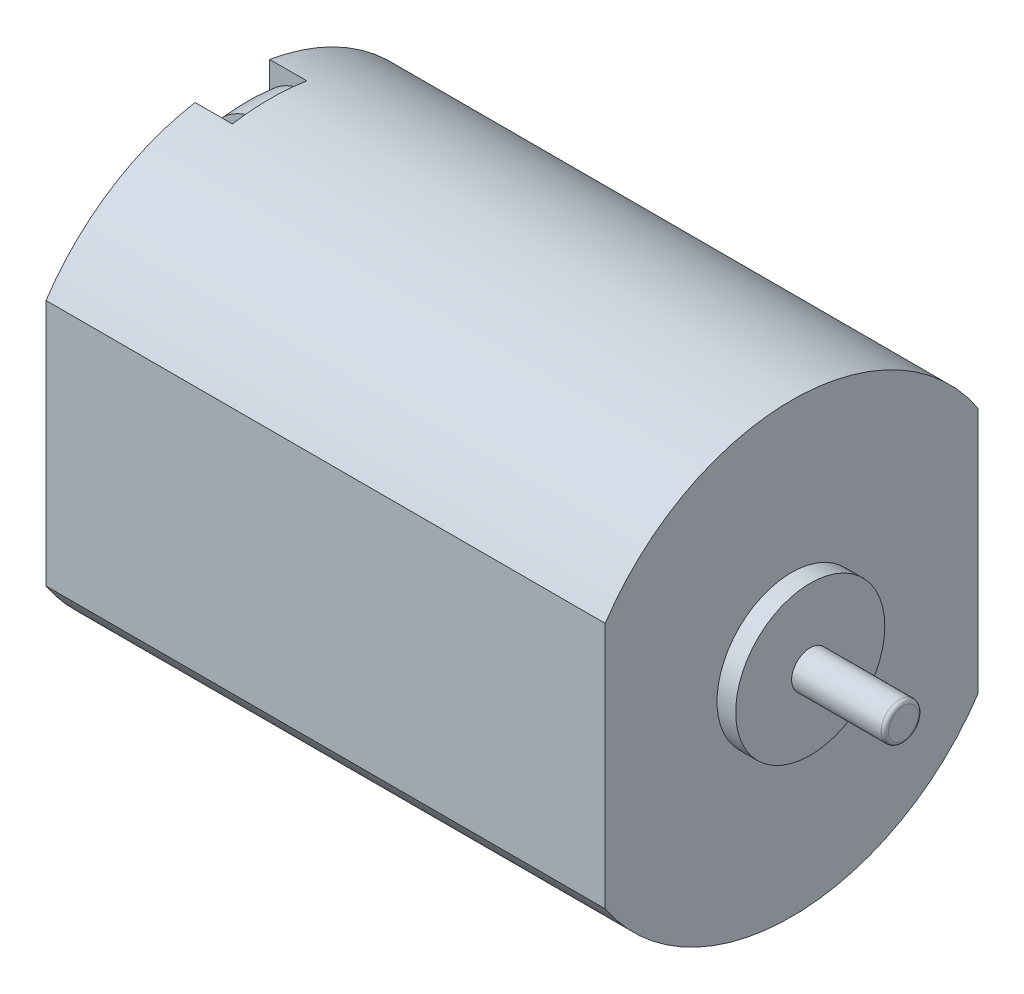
ISO-10303-21;
HEADER;
FILE_DESCRIPTION(('STEP AP214'),'2;1');
FILE_NAME('part.step','',(''),(''),'','','');
FILE_SCHEMA(('AUTOMOTIVE_DESIGN { 1 0 10303 214 1 1 1 1 }'));
ENDSEC;
DATA;
#1=APPLICATION_CONTEXT('core data for automotive mechanical design processes');
#2=APPLICATION_PROTOCOL_DEFINITION('international standard','automotive_design',2000,#1);
#3=PRODUCT_CONTEXT('',#1,'mechanical');
#4=PRODUCT('Part','Part','',(#3));
#5=PRODUCT_RELATED_PRODUCT_CATEGORY('part','',(#4));
#6=PRODUCT_DEFINITION_FORMATION('','',#4);
#7=PRODUCT_DEFINITION_CONTEXT('part definition',#1,'design');
#8=PRODUCT_DEFINITION('design','',#6,#7);
#9=PRODUCT_DEFINITION_SHAPE('','',#8);
#10=(LENGTH_UNIT() NAMED_UNIT(*) SI_UNIT(.MILLI.,.METRE.));
#11=(NAMED_UNIT(*) PLANE_ANGLE_UNIT() SI_UNIT($,.RADIAN.));
#12=(NAMED_UNIT(*) SI_UNIT($,.STERADIAN.) SOLID_ANGLE_UNIT());
#13=UNCERTAINTY_MEASURE_WITH_UNIT(LENGTH_MEASURE(1.E-05),#10,'distance_accuracy_value','');
#14=(GEOMETRIC_REPRESENTATION_CONTEXT(3) GLOBAL_UNCERTAINTY_ASSIGNED_CONTEXT((#13)) GLOBAL_UNIT_ASSIGNED_CONTEXT((#10,
#11,#12)) REPRESENTATION_CONTEXT('',''));
#15=CARTESIAN_POINT('',(0.,0.,0.));
#16=DIRECTION('',(0.,0.,1.));
#17=DIRECTION('',(1.,0.,0.));
#18=AXIS2_PLACEMENT_3D('',#15,#16,#17);
#19=CARTESIAN_POINT('',(-1.,0.,0.));
#20=DIRECTION('',(-1.,0.,0.));
#21=DIRECTION('',(0.,0.,1.));
#22=AXIS2_PLACEMENT_3D('',#19,#20,#21);
#23=PLANE('',#22);
#24=CARTESIAN_POINT('',(-1.,-3.03599718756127,-3.04511429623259));
#25=DIRECTION('',(-1.,0.,0.));
#26=DIRECTION('',(0.,0.,1.));
#27=AXIS2_PLACEMENT_3D('',#24,#25,#26);
#28=CIRCLE('',#27,1.);
#29=CARTESIAN_POINT('',(-1.,-3.03599718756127,-2.04511429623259));
#30=VERTEX_POINT('',#29);
#31=EDGE_CURVE('E398',#30,#30,#28,.T.);
#32=ORIENTED_EDGE('',*,*,#31,.F.);
#33=EDGE_LOOP('',(#32));
#34=FACE_BOUND('',#33,.T.);
#35=CARTESIAN_POINT('',(-1.,3.03599718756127,3.04511429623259));
#36=DIRECTION('',(-1.,0.,0.));
#37=DIRECTION('',(0.,0.,1.));
#38=AXIS2_PLACEMENT_3D('',#35,#36,#37);
#39=CIRCLE('',#38,1.);
#40=CARTESIAN_POINT('',(-1.,3.03599718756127,4.04511429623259));
#41=VERTEX_POINT('',#40);
#42=EDGE_CURVE('E416',#41,#41,#39,.T.);
#43=ORIENTED_EDGE('',*,*,#42,.F.);
#44=EDGE_LOOP('',(#43));
#45=FACE_BOUND('',#44,.T.);
#46=CARTESIAN_POINT('',(-1.,0.,0.));
#47=DIRECTION('',(-1.,0.,0.));
#48=DIRECTION('',(0.,0.,1.));
#49=AXIS2_PLACEMENT_3D('',#46,#47,#48);
#50=CIRCLE('',#49,2.5);
#51=CARTESIAN_POINT('',(-1.,0.,2.5));
#52=VERTEX_POINT('',#51);
#53=EDGE_CURVE('E427',#52,#52,#50,.T.);
#54=ORIENTED_EDGE('',*,*,#53,.F.);
#55=EDGE_LOOP('',(#54));
#56=FACE_BOUND('',#55,.T.);
#57=DIRECTION('',(0.,1.,0.));
#58=VECTOR('',#57,1.);
#59=CARTESIAN_POINT('',(-1.,0.,-1.));
#60=LINE('',#59,#58);
#61=CARTESIAN_POINT('',(-1.,-5.91607978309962,-1.));
#62=VERTEX_POINT('',#61);
#63=CARTESIAN_POINT('',(-1.,-4.6,-1.));
#64=VERTEX_POINT('',#63);
#65=EDGE_CURVE('E431',#62,#64,#60,.T.);
#66=ORIENTED_EDGE('',*,*,#65,.T.);
#67=DIRECTION('',(0.,0.,1.));
#68=VECTOR('',#67,1.);
#69=CARTESIAN_POINT('',(-1.,-4.6,0.));
#70=LINE('',#69,#68);
#71=CARTESIAN_POINT('',(-1.,-4.6,0.999999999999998));
#72=VERTEX_POINT('',#71);
#73=EDGE_CURVE('E434',#64,#72,#70,.T.);
#74=ORIENTED_EDGE('',*,*,#73,.T.);
#75=DIRECTION('',(0.,1.,0.));
#76=VECTOR('',#75,1.);
#77=CARTESIAN_POINT('',(-1.,0.,0.999999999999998));
#78=LINE('',#77,#76);
#79=CARTESIAN_POINT('',(-1.,-5.91607978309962,0.999999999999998));
#80=VERTEX_POINT('',#79);
#81=EDGE_CURVE('E437',#80,#72,#78,.T.);
#82=ORIENTED_EDGE('',*,*,#81,.F.);
#83=CARTESIAN_POINT('',(-1.,0.,0.));
#84=DIRECTION('',(-1.,0.,0.));
#85=DIRECTION('',(0.,0.,1.));
#86=AXIS2_PLACEMENT_3D('',#83,#84,#85);
#87=CIRCLE('',#86,6.);
#88=CARTESIAN_POINT('',(-1.,-3.3166247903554,5.));
#89=VERTEX_POINT('',#88);
#90=EDGE_CURVE('E440',#80,#89,#87,.T.);
#91=ORIENTED_EDGE('',*,*,#90,.T.);
#92=DIRECTION('',(0.,1.,0.));
#93=VECTOR('',#92,1.);
#94=CARTESIAN_POINT('',(-1.,0.,5.));
#95=LINE('',#94,#93);
#96=CARTESIAN_POINT('',(-1.,3.3166247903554,5.));
#97=VERTEX_POINT('',#96);
#98=EDGE_CURVE('E443',#89,#97,#95,.T.);
#99=ORIENTED_EDGE('',*,*,#98,.T.);
#100=CARTESIAN_POINT('',(-1.,0.,0.));
#101=DIRECTION('',(-1.,0.,0.));
#102=DIRECTION('',(0.,0.,1.));
#103=AXIS2_PLACEMENT_3D('',#100,#101,#102);
#104=CIRCLE('',#103,6.);
#105=CARTESIAN_POINT('',(-1.,5.91607978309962,1.));
#106=VERTEX_POINT('',#105);
#107=EDGE_CURVE('E447',#97,#106,#104,.T.);
#108=ORIENTED_EDGE('',*,*,#107,.T.);
#109=DIRECTION('',(0.,-1.,0.));
#110=VECTOR('',#109,1.);
#111=CARTESIAN_POINT('',(-1.,0.,1.));
#112=LINE('',#111,#110);
#113=CARTESIAN_POINT('',(-1.,4.6,1.));
#114=VERTEX_POINT('',#113);
#115=EDGE_CURVE('E449',#106,#114,#112,.T.);
#116=ORIENTED_EDGE('',*,*,#115,.T.);
#117=DIRECTION('',(0.,0.,1.));
#118=VECTOR('',#117,1.);
#119=CARTESIAN_POINT('',(-1.,4.6,0.));
#120=LINE('',#119,#118);
#121=CARTESIAN_POINT('',(-1.,4.6,-1.));
#122=VERTEX_POINT('',#121);
#123=EDGE_CURVE('E452',#122,#114,#120,.T.);
#124=ORIENTED_EDGE('',*,*,#123,.F.);
#125=DIRECTION('',(0.,-1.,0.));
#126=VECTOR('',#125,1.);
#127=CARTESIAN_POINT('',(-1.,0.,-0.999999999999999));
#128=LINE('',#127,#126);
#129=CARTESIAN_POINT('',(-1.,5.91607978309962,-1.));
#130=VERTEX_POINT('',#129);
#131=EDGE_CURVE('E455',#130,#122,#128,.T.);
#132=ORIENTED_EDGE('',*,*,#131,.F.);
#133=CARTESIAN_POINT('',(-1.,3.3166247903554,-5.));
#134=VERTEX_POINT('',#133);
#135=EDGE_CURVE('E450',#130,#134,#104,.T.);
#136=ORIENTED_EDGE('',*,*,#135,.T.);
#137=DIRECTION('',(0.,-1.,0.));
#138=VECTOR('',#137,1.);
#139=CARTESIAN_POINT('',(-1.,0.,-5.));
#140=LINE('',#139,#138);
#141=CARTESIAN_POINT('',(-1.,-3.3166247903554,-5.));
#142=VERTEX_POINT('',#141);
#143=EDGE_CURVE('E458',#134,#142,#140,.T.);
#144=ORIENTED_EDGE('',*,*,#143,.T.);
#145=EDGE_CURVE('E444',#142,#62,#87,.T.);
#146=ORIENTED_EDGE('',*,*,#145,.T.);
#147=EDGE_LOOP('',(#66,#74,#82,#91,#99,#108,#116,#124,#132,#136,#144,#146));
#148=FACE_BOUND('',#147,.T.);
#149=DIRECTION('',(0.,0.,1.));
#150=VECTOR('',#149,1.);
#151=CARTESIAN_POINT('',(-1.,3.4,0.749999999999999));
#152=LINE('',#151,#150);
#153=CARTESIAN_POINT('',(-1.,3.4,-0.750000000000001));
#154=VERTEX_POINT('',#153);
#155=CARTESIAN_POINT('',(-1.,3.4,0.749999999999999));
#156=VERTEX_POINT('',#155);
#157=EDGE_CURVE('E299',#154,#156,#152,.T.);
#158=ORIENTED_EDGE('',*,*,#157,.F.);
#159=DIRECTION('',(0.,-1.,0.));
#160=VECTOR('',#159,1.);
#161=CARTESIAN_POINT('',(-1.,3.7,-0.750000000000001));
#162=LINE('',#161,#160);
#163=CARTESIAN_POINT('',(-1.,3.7,-0.750000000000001));
#164=VERTEX_POINT('',#163);
#165=EDGE_CURVE('E262',#164,#154,#162,.T.);
#166=ORIENTED_EDGE('',*,*,#165,.F.);
#167=DIRECTION('',(0.,0.,-1.));
#168=VECTOR('',#167,1.);
#169=CARTESIAN_POINT('',(-1.,3.7,0.749999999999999));
#170=LINE('',#169,#168);
#171=CARTESIAN_POINT('',(-1.,3.7,0.749999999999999));
#172=VERTEX_POINT('',#171);
#173=EDGE_CURVE('E293',#172,#164,#170,.T.);
#174=ORIENTED_EDGE('',*,*,#173,.F.);
#175=DIRECTION('',(0.,1.,0.));
#176=VECTOR('',#175,1.);
#177=CARTESIAN_POINT('',(-1.,3.7,0.749999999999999));
#178=LINE('',#177,#176);
#179=EDGE_CURVE('E302',#156,#172,#178,.T.);
#180=ORIENTED_EDGE('',*,*,#179,.F.);
#181=EDGE_LOOP('',(#158,#166,#174,#180));
#182=FACE_BOUND('',#181,.T.);
#183=DIRECTION('',(0.,0.,-1.));
#184=VECTOR('',#183,1.);
#185=CARTESIAN_POINT('',(-1.,-3.4,-0.749999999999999));
#186=LINE('',#185,#184);
#187=CARTESIAN_POINT('',(-1.,-3.4,0.750000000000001));
#188=VERTEX_POINT('',#187);
#189=CARTESIAN_POINT('',(-1.,-3.4,-0.749999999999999));
#190=VERTEX_POINT('',#189);
#191=EDGE_CURVE('E256',#188,#190,#186,.T.);
#192=ORIENTED_EDGE('',*,*,#191,.F.);
#193=DIRECTION('',(0.,1.,0.));
#194=VECTOR('',#193,1.);
#195=CARTESIAN_POINT('',(-1.,-3.7,0.750000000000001));
#196=LINE('',#195,#194);
#197=CARTESIAN_POINT('',(-1.,-3.7,0.750000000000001));
#198=VERTEX_POINT('',#197);
#199=EDGE_CURVE('E266',#198,#188,#196,.T.);
#200=ORIENTED_EDGE('',*,*,#199,.F.);
#201=DIRECTION('',(0.,0.,1.));
#202=VECTOR('',#201,1.);
#203=CARTESIAN_POINT('',(-1.,-3.7,-0.749999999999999));
#204=LINE('',#203,#202);
#205=CARTESIAN_POINT('',(-1.,-3.7,-0.749999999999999));
#206=VERTEX_POINT('',#205);
#207=EDGE_CURVE('E278',#206,#198,#204,.T.);
#208=ORIENTED_EDGE('',*,*,#207,.F.);
#209=DIRECTION('',(0.,-1.,0.));
#210=VECTOR('',#209,1.);
#211=CARTESIAN_POINT('',(-1.,-3.7,-0.749999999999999));
#212=LINE('',#211,#210);
#213=EDGE_CURVE('E276',#190,#206,#212,.T.);
#214=ORIENTED_EDGE('',*,*,#213,.F.);
#215=EDGE_LOOP('',(#192,#200,#208,#214));
#216=FACE_BOUND('',#215,.T.);
#217=ADVANCED_FACE('F41',(#34,#45,#56,#148,#182,#216),#23,.T.);
#218=CARTESIAN_POINT('',(0.,0.,0.));
#219=DIRECTION('',(1.,0.,0.));
#220=DIRECTION('',(0.,0.,-1.));
#221=AXIS2_PLACEMENT_3D('',#218,#219,#220);
#222=PLANE('',#221);
#223=DIRECTION('',(0.,0.,-1.));
#224=VECTOR('',#223,1.);
#225=CARTESIAN_POINT('',(0.,-5.6646877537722,0.65));
#226=LINE('',#225,#224);
#227=CARTESIAN_POINT('',(0.,-5.6646877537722,0.65));
#228=VERTEX_POINT('',#227);
#229=CARTESIAN_POINT('',(0.,-5.6646877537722,-0.65));
#230=VERTEX_POINT('',#229);
#231=EDGE_CURVE('E322',#228,#230,#226,.T.);
#232=ORIENTED_EDGE('',*,*,#231,.F.);
#233=DIRECTION('',(0.,1.,0.));
#234=VECTOR('',#233,1.);
#235=CARTESIAN_POINT('',(0.,-5.9646877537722,0.65));
#236=LINE('',#235,#234);
#237=CARTESIAN_POINT('',(0.,-5.9646877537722,0.65));
#238=VERTEX_POINT('',#237);
#239=EDGE_CURVE('E316',#238,#228,#236,.T.);
#240=ORIENTED_EDGE('',*,*,#239,.F.);
#241=CARTESIAN_POINT('',(0.,0.,0.));
#242=DIRECTION('',(1.,0.,0.));
#243=DIRECTION('',(0.,0.,-1.));
#244=AXIS2_PLACEMENT_3D('',#241,#242,#243);
#245=CIRCLE('',#244,6.);
#246=CARTESIAN_POINT('',(0.,-5.91607978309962,0.999999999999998));
#247=VERTEX_POINT('',#246);
#248=EDGE_CURVE('E510',#247,#238,#245,.T.);
#249=ORIENTED_EDGE('',*,*,#248,.F.);
#250=DIRECTION('',(0.,1.,0.));
#251=VECTOR('',#250,1.);
#252=CARTESIAN_POINT('',(0.,0.,0.999999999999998));
#253=LINE('',#252,#251);
#254=CARTESIAN_POINT('',(0.,-4.6,0.999999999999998));
#255=VERTEX_POINT('',#254);
#256=EDGE_CURVE('E466',#247,#255,#253,.T.);
#257=ORIENTED_EDGE('',*,*,#256,.T.);
#258=DIRECTION('',(0.,0.,1.));
#259=VECTOR('',#258,1.);
#260=CARTESIAN_POINT('',(0.,-4.6,0.));
#261=LINE('',#260,#259);
#262=CARTESIAN_POINT('',(0.,-4.6,-1.));
#263=VERTEX_POINT('',#262);
#264=EDGE_CURVE('E463',#263,#255,#261,.T.);
#265=ORIENTED_EDGE('',*,*,#264,.F.);
#266=DIRECTION('',(0.,1.,0.));
#267=VECTOR('',#266,1.);
#268=CARTESIAN_POINT('',(0.,0.,-1.));
#269=LINE('',#268,#267);
#270=CARTESIAN_POINT('',(0.,-5.91607978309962,-1.));
#271=VERTEX_POINT('',#270);
#272=EDGE_CURVE('E430',#271,#263,#269,.T.);
#273=ORIENTED_EDGE('',*,*,#272,.F.);
#274=CARTESIAN_POINT('',(0.,-5.9646877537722,-0.649999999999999));
#275=VERTEX_POINT('',#274);
#276=EDGE_CURVE('E498',#275,#271,#245,.T.);
#277=ORIENTED_EDGE('',*,*,#276,.F.);
#278=DIRECTION('',(0.,-1.,0.));
#279=VECTOR('',#278,1.);
#280=CARTESIAN_POINT('',(0.,-5.9646877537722,-0.65));
#281=LINE('',#280,#279);
#282=EDGE_CURVE('E335',#230,#275,#281,.T.);
#283=ORIENTED_EDGE('',*,*,#282,.F.);
#284=EDGE_LOOP('',(#232,#240,#249,#257,#265,#273,#277,#283));
#285=FACE_BOUND('',#284,.T.);
#286=ADVANCED_FACE('F578',(#285),#222,.F.);
#287=CARTESIAN_POINT('',(14.,0.,0.));
#288=DIRECTION('',(-1.,0.,0.));
#289=DIRECTION('',(0.,0.,1.));
#290=AXIS2_PLACEMENT_3D('',#287,#288,#289);
#291=CYLINDRICAL_SURFACE('',#290,6.);
#292=DIRECTION('',(-1.,0.,0.));
#293=VECTOR('',#292,1.);
#294=CARTESIAN_POINT('',(14.,-3.3166247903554,5.));
#295=LINE('',#294,#293);
#296=CARTESIAN_POINT('',(14.,-3.3166247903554,5.));
#297=VERTEX_POINT('',#296);
#298=EDGE_CURVE('E509',#297,#89,#295,.T.);
#299=ORIENTED_EDGE('',*,*,#298,.T.);
#300=ORIENTED_EDGE('',*,*,#90,.F.);
#301=DIRECTION('',(1.,0.,0.));
#302=VECTOR('',#301,1.);
#303=CARTESIAN_POINT('',(-1.,-5.91607978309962,0.999999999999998));
#304=LINE('',#303,#302);
#305=EDGE_CURVE('E489',#80,#247,#304,.T.);
#306=ORIENTED_EDGE('',*,*,#305,.T.);
#307=ORIENTED_EDGE('',*,*,#248,.T.);
#308=CARTESIAN_POINT('',(0.,0.,0.));
#309=DIRECTION('',(-1.,0.,0.));
#310=DIRECTION('',(0.,0.,-1.));
#311=AXIS2_PLACEMENT_3D('',#308,#309,#310);
#312=CIRCLE('',#311,6.);
#313=EDGE_CURVE('E314',#275,#238,#312,.T.);
#314=ORIENTED_EDGE('',*,*,#313,.F.);
#315=ORIENTED_EDGE('',*,*,#276,.T.);
#316=DIRECTION('',(1.,0.,0.));
#317=VECTOR('',#316,1.);
#318=CARTESIAN_POINT('',(-1.,-5.91607978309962,-1.));
#319=LINE('',#318,#317);
#320=EDGE_CURVE('E474',#62,#271,#319,.T.);
#321=ORIENTED_EDGE('',*,*,#320,.F.);
#322=ORIENTED_EDGE('',*,*,#145,.F.);
#323=DIRECTION('',(-1.,0.,0.));
#324=VECTOR('',#323,1.);
#325=CARTESIAN_POINT('',(14.,-3.3166247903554,-5.));
#326=LINE('',#325,#324);
#327=CARTESIAN_POINT('',(14.,-3.3166247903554,-5.));
#328=VERTEX_POINT('',#327);
#329=EDGE_CURVE('E521',#328,#142,#326,.T.);
#330=ORIENTED_EDGE('',*,*,#329,.F.);
#331=CARTESIAN_POINT('',(14.,0.,0.));
#332=DIRECTION('',(1.,0.,0.));
#333=DIRECTION('',(0.,0.,-1.));
#334=AXIS2_PLACEMENT_3D('',#331,#332,#333);
#335=CIRCLE('',#334,6.);
#336=EDGE_CURVE('E499',#297,#328,#335,.T.);
#337=ORIENTED_EDGE('',*,*,#336,.F.);
#338=EDGE_LOOP('',(#299,#300,#306,#307,#314,#315,#321,#322,#330,#337));
#339=FACE_BOUND('',#338,.T.);
#340=ADVANCED_FACE('F585',(#339),#291,.T.);
#341=CARTESIAN_POINT('',(14.,3.3166247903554,-5.));
#342=DIRECTION('',(0.,0.,1.));
#343=DIRECTION('',(0.,-1.,0.));
#344=AXIS2_PLACEMENT_3D('',#341,#342,#343);
#345=PLANE('',#344);
#346=ORIENTED_EDGE('',*,*,#329,.T.);
#347=ORIENTED_EDGE('',*,*,#143,.F.);
#348=DIRECTION('',(-1.,0.,0.));
#349=VECTOR('',#348,1.);
#350=CARTESIAN_POINT('',(14.,3.3166247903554,-5.));
#351=LINE('',#350,#349);
#352=CARTESIAN_POINT('',(14.,3.3166247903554,-5.));
#353=VERTEX_POINT('',#352);
#354=EDGE_CURVE('E519',#353,#134,#351,.T.);
#355=ORIENTED_EDGE('',*,*,#354,.F.);
#356=DIRECTION('',(0.,1.,0.));
#357=VECTOR('',#356,1.);
#358=CARTESIAN_POINT('',(14.,3.3166247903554,-5.));
#359=LINE('',#358,#357);
#360=EDGE_CURVE('E502',#328,#353,#359,.T.);
#361=ORIENTED_EDGE('',*,*,#360,.F.);
#362=EDGE_LOOP('',(#346,#347,#355,#361));
#363=FACE_BOUND('',#362,.T.);
#364=ADVANCED_FACE('F665',(#363),#345,.F.);
#365=CARTESIAN_POINT('',(14.,0.,0.));
#366=DIRECTION('',(-1.,0.,0.));
#367=DIRECTION('',(0.,0.,1.));
#368=AXIS2_PLACEMENT_3D('',#365,#366,#367);
#369=CYLINDRICAL_SURFACE('',#368,6.);
#370=ORIENTED_EDGE('',*,*,#354,.T.);
#371=ORIENTED_EDGE('',*,*,#135,.F.);
#372=DIRECTION('',(1.,0.,0.));
#373=VECTOR('',#372,1.);
#374=CARTESIAN_POINT('',(-1.,5.91607978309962,-1.));
#375=LINE('',#374,#373);
#376=CARTESIAN_POINT('',(0.,5.91607978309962,-1.));
#377=VERTEX_POINT('',#376);
#378=EDGE_CURVE('E477',#130,#377,#375,.T.);
#379=ORIENTED_EDGE('',*,*,#378,.T.);
#380=CARTESIAN_POINT('',(0.,0.,0.));
#381=DIRECTION('',(1.,0.,0.));
#382=DIRECTION('',(0.,0.,-1.));
#383=AXIS2_PLACEMENT_3D('',#380,#381,#382);
#384=CIRCLE('',#383,6.);
#385=CARTESIAN_POINT('',(0.,5.9646877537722,-0.65));
#386=VERTEX_POINT('',#385);
#387=EDGE_CURVE('E503',#377,#386,#384,.T.);
#388=ORIENTED_EDGE('',*,*,#387,.T.);
#389=CARTESIAN_POINT('',(0.,0.,0.));
#390=DIRECTION('',(-1.,0.,0.));
#391=DIRECTION('',(0.,0.,1.));
#392=AXIS2_PLACEMENT_3D('',#389,#390,#391);
#393=CIRCLE('',#392,6.);
#394=CARTESIAN_POINT('',(0.,5.9646877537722,0.65));
#395=VERTEX_POINT('',#394);
#396=EDGE_CURVE('E349',#395,#386,#393,.T.);
#397=ORIENTED_EDGE('',*,*,#396,.F.);
#398=CARTESIAN_POINT('',(0.,5.91607978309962,1.));
#399=VERTEX_POINT('',#398);
#400=EDGE_CURVE('E513',#395,#399,#384,.T.);
#401=ORIENTED_EDGE('',*,*,#400,.T.);
#402=DIRECTION('',(1.,0.,0.));
#403=VECTOR('',#402,1.);
#404=CARTESIAN_POINT('',(-1.,5.91607978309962,1.));
#405=LINE('',#404,#403);
#406=EDGE_CURVE('E486',#106,#399,#405,.T.);
#407=ORIENTED_EDGE('',*,*,#406,.F.);
#408=ORIENTED_EDGE('',*,*,#107,.F.);
#409=DIRECTION('',(-1.,0.,0.));
#410=VECTOR('',#409,1.);
#411=CARTESIAN_POINT('',(14.,3.3166247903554,5.));
#412=LINE('',#411,#410);
#413=CARTESIAN_POINT('',(14.,3.3166247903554,5.));
#414=VERTEX_POINT('',#413);
#415=EDGE_CURVE('E517',#414,#97,#412,.T.);
#416=ORIENTED_EDGE('',*,*,#415,.F.);
#417=CARTESIAN_POINT('',(14.,0.,0.));
#418=DIRECTION('',(1.,0.,0.));
#419=DIRECTION('',(0.,0.,-1.));
#420=AXIS2_PLACEMENT_3D('',#417,#418,#419);
#421=CIRCLE('',#420,6.);
#422=EDGE_CURVE('E505',#353,#414,#421,.T.);
#423=ORIENTED_EDGE('',*,*,#422,.F.);
#424=EDGE_LOOP('',(#370,#371,#379,#388,#397,#401,#407,#408,#416,#423));
#425=FACE_BOUND('',#424,.T.);
#426=ADVANCED_FACE('F661',(#425),#369,.T.);
#427=CARTESIAN_POINT('',(14.,3.3166247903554,5.));
#428=DIRECTION('',(0.,0.,-1.));
#429=DIRECTION('',(0.,1.,0.));
#430=AXIS2_PLACEMENT_3D('',#427,#428,#429);
#431=PLANE('',#430);
#432=ORIENTED_EDGE('',*,*,#415,.T.);
#433=ORIENTED_EDGE('',*,*,#98,.F.);
#434=ORIENTED_EDGE('',*,*,#298,.F.);
#435=DIRECTION('',(0.,-1.,0.));
#436=VECTOR('',#435,1.);
#437=CARTESIAN_POINT('',(14.,3.3166247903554,5.));
#438=LINE('',#437,#436);
#439=EDGE_CURVE('E507',#414,#297,#438,.T.);
#440=ORIENTED_EDGE('',*,*,#439,.F.);
#441=EDGE_LOOP('',(#432,#433,#434,#440));
#442=FACE_BOUND('',#441,.T.);
#443=ADVANCED_FACE('F654',(#442),#431,.F.);
#444=CARTESIAN_POINT('',(14.,0.,0.));
#445=DIRECTION('',(1.,0.,0.));
#446=DIRECTION('',(0.,0.,-1.));
#447=AXIS2_PLACEMENT_3D('',#444,#445,#446);
#448=PLANE('',#447);
#449=CARTESIAN_POINT('',(14.,0.,0.));
#450=DIRECTION('',(1.,0.,0.));
#451=DIRECTION('',(0.,0.,-1.));
#452=AXIS2_PLACEMENT_3D('',#449,#450,#451);
#453=CIRCLE('',#452,2.);
#454=CARTESIAN_POINT('',(14.,0.,-2.));
#455=VERTEX_POINT('',#454);
#456=EDGE_CURVE('E1234',#455,#455,#453,.T.);
#457=ORIENTED_EDGE('',*,*,#456,.F.);
#458=EDGE_LOOP('',(#457));
#459=FACE_BOUND('',#458,.T.);
#460=ORIENTED_EDGE('',*,*,#336,.T.);
#461=ORIENTED_EDGE('',*,*,#360,.T.);
#462=ORIENTED_EDGE('',*,*,#422,.T.);
#463=ORIENTED_EDGE('',*,*,#439,.T.);
#464=EDGE_LOOP('',(#460,#461,#462,#463));
#465=FACE_BOUND('',#464,.T.);
#466=ADVANCED_FACE('F652',(#459,#465),#448,.T.);
#467=DIRECTION('',(0.,0.,1.));
#468=VECTOR('',#467,1.);
#469=CARTESIAN_POINT('',(0.,5.6646877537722,-0.65));
#470=LINE('',#469,#468);
#471=CARTESIAN_POINT('',(0.,5.6646877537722,-0.65));
#472=VERTEX_POINT('',#471);
#473=CARTESIAN_POINT('',(0.,5.6646877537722,0.65));
#474=VERTEX_POINT('',#473);
#475=EDGE_CURVE('E371',#472,#474,#470,.T.);
#476=ORIENTED_EDGE('',*,*,#475,.F.);
#477=DIRECTION('',(0.,-1.,0.));
#478=VECTOR('',#477,1.);
#479=CARTESIAN_POINT('',(0.,5.9646877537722,-0.65));
#480=LINE('',#479,#478);
#481=EDGE_CURVE('E365',#386,#472,#480,.T.);
#482=ORIENTED_EDGE('',*,*,#481,.F.);
#483=ORIENTED_EDGE('',*,*,#387,.F.);
#484=DIRECTION('',(0.,-1.,0.));
#485=VECTOR('',#484,1.);
#486=CARTESIAN_POINT('',(0.,0.,-0.999999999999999));
#487=LINE('',#486,#485);
#488=CARTESIAN_POINT('',(0.,4.6,-1.));
#489=VERTEX_POINT('',#488);
#490=EDGE_CURVE('E435',#377,#489,#487,.T.);
#491=ORIENTED_EDGE('',*,*,#490,.T.);
#492=DIRECTION('',(0.,0.,1.));
#493=VECTOR('',#492,1.);
#494=CARTESIAN_POINT('',(0.,4.6,0.));
#495=LINE('',#494,#493);
#496=CARTESIAN_POINT('',(0.,4.6,1.));
#497=VERTEX_POINT('',#496);
#498=EDGE_CURVE('E471',#489,#497,#495,.T.);
#499=ORIENTED_EDGE('',*,*,#498,.T.);
#500=DIRECTION('',(0.,-1.,0.));
#501=VECTOR('',#500,1.);
#502=CARTESIAN_POINT('',(0.,0.,1.));
#503=LINE('',#502,#501);
#504=EDGE_CURVE('E468',#399,#497,#503,.T.);
#505=ORIENTED_EDGE('',*,*,#504,.F.);
#506=ORIENTED_EDGE('',*,*,#400,.F.);
#507=DIRECTION('',(0.,1.,0.));
#508=VECTOR('',#507,1.);
#509=CARTESIAN_POINT('',(0.,5.9646877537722,0.65));
#510=LINE('',#509,#508);
#511=EDGE_CURVE('E385',#474,#395,#510,.T.);
#512=ORIENTED_EDGE('',*,*,#511,.F.);
#513=EDGE_LOOP('',(#476,#482,#483,#491,#499,#505,#506,#512));
#514=FACE_BOUND('',#513,.T.);
#515=ADVANCED_FACE('F588',(#514),#222,.F.);
#516=CARTESIAN_POINT('',(-1.,0.,-1.));
#517=DIRECTION('',(0.,0.,-1.));
#518=DIRECTION('',(0.,1.,0.));
#519=AXIS2_PLACEMENT_3D('',#516,#517,#518);
#520=PLANE('',#519);
#521=ORIENTED_EDGE('',*,*,#272,.T.);
#522=DIRECTION('',(1.,0.,0.));
#523=VECTOR('',#522,1.);
#524=CARTESIAN_POINT('',(-1.,-4.6,-1.));
#525=LINE('',#524,#523);
#526=EDGE_CURVE('E495',#64,#263,#525,.T.);
#527=ORIENTED_EDGE('',*,*,#526,.F.);
#528=ORIENTED_EDGE('',*,*,#65,.F.);
#529=ORIENTED_EDGE('',*,*,#320,.T.);
#530=EDGE_LOOP('',(#521,#527,#528,#529));
#531=FACE_BOUND('',#530,.T.);
#532=ADVANCED_FACE('F647',(#531),#520,.F.);
#533=CARTESIAN_POINT('',(-1.,-4.6,0.));
#534=DIRECTION('',(0.,1.,0.));
#535=DIRECTION('',(0.,0.,1.));
#536=AXIS2_PLACEMENT_3D('',#533,#534,#535);
#537=PLANE('',#536);
#538=ORIENTED_EDGE('',*,*,#264,.T.);
#539=DIRECTION('',(1.,0.,0.));
#540=VECTOR('',#539,1.);
#541=CARTESIAN_POINT('',(-1.,-4.6,0.999999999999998));
#542=LINE('',#541,#540);
#543=EDGE_CURVE('E492',#72,#255,#542,.T.);
#544=ORIENTED_EDGE('',*,*,#543,.F.);
#545=ORIENTED_EDGE('',*,*,#73,.F.);
#546=ORIENTED_EDGE('',*,*,#526,.T.);
#547=EDGE_LOOP('',(#538,#544,#545,#546));
#548=FACE_BOUND('',#547,.T.);
#549=ADVANCED_FACE('F643',(#548),#537,.F.);
#550=CARTESIAN_POINT('',(-1.,0.,0.999999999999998));
#551=DIRECTION('',(0.,0.,-1.));
#552=DIRECTION('',(-1.,0.,0.));
#553=AXIS2_PLACEMENT_3D('',#550,#551,#552);
#554=PLANE('',#553);
#555=ORIENTED_EDGE('',*,*,#256,.F.);
#556=ORIENTED_EDGE('',*,*,#305,.F.);
#557=ORIENTED_EDGE('',*,*,#81,.T.);
#558=ORIENTED_EDGE('',*,*,#543,.T.);
#559=EDGE_LOOP('',(#555,#556,#557,#558));
#560=FACE_BOUND('',#559,.T.);
#561=ADVANCED_FACE('F639',(#560),#554,.T.);
#562=CARTESIAN_POINT('',(-1.,0.,1.));
#563=DIRECTION('',(0.,0.,1.));
#564=DIRECTION('',(1.,0.,0.));
#565=AXIS2_PLACEMENT_3D('',#562,#563,#564);
#566=PLANE('',#565);
#567=ORIENTED_EDGE('',*,*,#504,.T.);
#568=DIRECTION('',(1.,0.,0.));
#569=VECTOR('',#568,1.);
#570=CARTESIAN_POINT('',(-1.,4.6,1.));
#571=LINE('',#570,#569);
#572=EDGE_CURVE('E483',#114,#497,#571,.T.);
#573=ORIENTED_EDGE('',*,*,#572,.F.);
#574=ORIENTED_EDGE('',*,*,#115,.F.);
#575=ORIENTED_EDGE('',*,*,#406,.T.);
#576=EDGE_LOOP('',(#567,#573,#574,#575));
#577=FACE_BOUND('',#576,.T.);
#578=ADVANCED_FACE('F632',(#577),#566,.F.);
#579=CARTESIAN_POINT('',(-1.,4.6,0.));
#580=DIRECTION('',(0.,1.,0.));
#581=DIRECTION('',(0.,0.,1.));
#582=AXIS2_PLACEMENT_3D('',#579,#580,#581);
#583=PLANE('',#582);
#584=ORIENTED_EDGE('',*,*,#498,.F.);
#585=DIRECTION('',(1.,0.,0.));
#586=VECTOR('',#585,1.);
#587=CARTESIAN_POINT('',(-1.,4.6,-1.));
#588=LINE('',#587,#586);
#589=EDGE_CURVE('E480',#122,#489,#588,.T.);
#590=ORIENTED_EDGE('',*,*,#589,.F.);
#591=ORIENTED_EDGE('',*,*,#123,.T.);
#592=ORIENTED_EDGE('',*,*,#572,.T.);
#593=EDGE_LOOP('',(#584,#590,#591,#592));
#594=FACE_BOUND('',#593,.T.);
#595=ADVANCED_FACE('F623',(#594),#583,.T.);
#596=CARTESIAN_POINT('',(-1.,0.,-0.999999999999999));
#597=DIRECTION('',(0.,0.,1.));
#598=DIRECTION('',(0.,-1.,0.));
#599=AXIS2_PLACEMENT_3D('',#596,#597,#598);
#600=PLANE('',#599);
#601=ORIENTED_EDGE('',*,*,#490,.F.);
#602=ORIENTED_EDGE('',*,*,#378,.F.);
#603=ORIENTED_EDGE('',*,*,#131,.T.);
#604=ORIENTED_EDGE('',*,*,#589,.T.);
#605=EDGE_LOOP('',(#601,#602,#603,#604));
#606=FACE_BOUND('',#605,.T.);
#607=ADVANCED_FACE('F618',(#606),#600,.T.);
#608=CARTESIAN_POINT('',(-2.,0.,0.));
#609=DIRECTION('',(-1.,0.,0.));
#610=DIRECTION('',(0.,0.,1.));
#611=AXIS2_PLACEMENT_3D('',#608,#609,#610);
#612=PLANE('',#611);
#613=CARTESIAN_POINT('',(-2.,0.,0.));
#614=DIRECTION('',(-1.,0.,0.));
#615=DIRECTION('',(0.,0.,1.));
#616=AXIS2_PLACEMENT_3D('',#613,#614,#615);
#617=CIRCLE('',#616,2.3);
#618=CARTESIAN_POINT('',(-2.,0.,2.3));
#619=VERTEX_POINT('',#618);
#620=EDGE_CURVE('E526',#619,#619,#617,.T.);
#621=ORIENTED_EDGE('',*,*,#620,.T.);
#622=EDGE_LOOP('',(#621));
#623=FACE_BOUND('',#622,.T.);
#624=CARTESIAN_POINT('',(-2.,0.,0.));
#625=DIRECTION('',(-1.,0.,0.));
#626=DIRECTION('',(0.,0.,1.));
#627=AXIS2_PLACEMENT_3D('',#624,#625,#626);
#628=CIRCLE('',#627,1.);
#629=CARTESIAN_POINT('',(-2.,0.,1.));
#630=VERTEX_POINT('',#629);
#631=EDGE_CURVE('E422',#630,#630,#628,.T.);
#632=ORIENTED_EDGE('',*,*,#631,.F.);
#633=EDGE_LOOP('',(#632));
#634=FACE_BOUND('',#633,.T.);
#635=ADVANCED_FACE('F612',(#623,#634),#612,.T.);
#636=CARTESIAN_POINT('',(-2.,0.,0.));
#637=DIRECTION('',(1.,0.,0.));
#638=DIRECTION('',(0.,0.,-1.));
#639=AXIS2_PLACEMENT_3D('',#636,#637,#638);
#640=CYLINDRICAL_SURFACE('',#639,2.5);
#641=CARTESIAN_POINT('',(-1.8,0.,0.));
#642=DIRECTION('',(-1.,0.,0.));
#643=DIRECTION('',(0.,0.,1.));
#644=AXIS2_PLACEMENT_3D('',#641,#642,#643);
#645=CIRCLE('',#644,2.5);
#646=CARTESIAN_POINT('',(-1.8,0.,2.5));
#647=VERTEX_POINT('',#646);
#648=EDGE_CURVE('E529',#647,#647,#645,.F.);
#649=ORIENTED_EDGE('',*,*,#648,.T.);
#650=EDGE_LOOP('',(#649));
#651=FACE_BOUND('',#650,.T.);
#652=ORIENTED_EDGE('',*,*,#53,.T.);
#653=EDGE_LOOP('',(#652));
#654=FACE_BOUND('',#653,.T.);
#655=ADVANCED_FACE('F604',(#651,#654),#640,.T.);
#656=CARTESIAN_POINT('',(-2.,0.,0.));
#657=DIRECTION('',(1.,0.,0.));
#658=DIRECTION('',(0.,0.,-1.));
#659=AXIS2_PLACEMENT_3D('',#656,#657,#658);
#660=CYLINDRICAL_SURFACE('',#659,1.);
#661=ORIENTED_EDGE('',*,*,#631,.T.);
#662=EDGE_LOOP('',(#661));
#663=FACE_BOUND('',#662,.T.);
#664=CARTESIAN_POINT('',(-1.,0.,0.));
#665=DIRECTION('',(-1.,0.,0.));
#666=DIRECTION('',(0.,0.,1.));
#667=AXIS2_PLACEMENT_3D('',#664,#665,#666);
#668=CIRCLE('',#667,1.);
#669=CARTESIAN_POINT('',(-1.,0.,1.));
#670=VERTEX_POINT('',#669);
#671=EDGE_CURVE('E523',#670,#670,#668,.F.);
#672=ORIENTED_EDGE('',*,*,#671,.T.);
#673=EDGE_LOOP('',(#672));
#674=FACE_BOUND('',#673,.T.);
#675=ADVANCED_FACE('F595',(#663,#674),#660,.F.);
#676=ORIENTED_EDGE('',*,*,#671,.F.);
#677=EDGE_LOOP('',(#676));
#678=FACE_BOUND('',#677,.T.);
#679=ADVANCED_FACE('F581',(#678),#23,.T.);
#680=CARTESIAN_POINT('',(-1.8,0.,0.));
#681=DIRECTION('',(-1.,0.,0.));
#682=DIRECTION('',(0.,0.,1.));
#683=AXIS2_PLACEMENT_3D('',#680,#681,#682);
#684=TOROIDAL_SURFACE('',#683,2.3,0.2);
#685=ORIENTED_EDGE('',*,*,#648,.F.);
#686=EDGE_LOOP('',(#685));
#687=FACE_BOUND('',#686,.T.);
#688=ORIENTED_EDGE('',*,*,#620,.F.);
#689=EDGE_LOOP('',(#688));
#690=FACE_BOUND('',#689,.T.);
#691=ADVANCED_FACE('F594',(#687,#690),#684,.T.);
#692=CARTESIAN_POINT('',(-0.5,3.03599718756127,3.04511429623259));
#693=DIRECTION('',(-1.,0.,0.));
#694=DIRECTION('',(0.,0.,1.));
#695=AXIS2_PLACEMENT_3D('',#692,#693,#694);
#696=CYLINDRICAL_SURFACE('',#695,1.);
#697=CARTESIAN_POINT('',(-0.5,3.03599718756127,3.04511429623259));
#698=DIRECTION('',(-1.,0.,0.));
#699=DIRECTION('',(0.,0.,1.));
#700=AXIS2_PLACEMENT_3D('',#697,#698,#699);
#701=CIRCLE('',#700,1.);
#702=CARTESIAN_POINT('',(-0.5,3.03599718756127,4.04511429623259));
#703=VERTEX_POINT('',#702);
#704=EDGE_CURVE('E419',#703,#703,#701,.T.);
#705=ORIENTED_EDGE('',*,*,#704,.F.);
#706=EDGE_LOOP('',(#705));
#707=FACE_BOUND('',#706,.T.);
#708=ORIENTED_EDGE('',*,*,#42,.T.);
#709=EDGE_LOOP('',(#708));
#710=FACE_BOUND('',#709,.T.);
#711=ADVANCED_FACE('F601',(#707,#710),#696,.F.);
#712=CARTESIAN_POINT('',(-0.5,3.03599718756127,3.04511429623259));
#713=DIRECTION('',(-1.,0.,0.));
#714=DIRECTION('',(0.,0.,1.));
#715=AXIS2_PLACEMENT_3D('',#712,#713,#714);
#716=PLANE('',#715);
#717=ORIENTED_EDGE('',*,*,#704,.T.);
#718=EDGE_LOOP('',(#717));
#719=FACE_BOUND('',#718,.T.);
#720=ADVANCED_FACE('F829',(#719),#716,.T.);
#721=CARTESIAN_POINT('',(-0.5,-3.03599718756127,-3.04511429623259));
#722=DIRECTION('',(-1.,0.,0.));
#723=DIRECTION('',(0.,0.,1.));
#724=AXIS2_PLACEMENT_3D('',#721,#722,#723);
#725=CYLINDRICAL_SURFACE('',#724,1.);
#726=CARTESIAN_POINT('',(-0.5,-3.03599718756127,-3.04511429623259));
#727=DIRECTION('',(-1.,0.,0.));
#728=DIRECTION('',(0.,0.,1.));
#729=AXIS2_PLACEMENT_3D('',#726,#727,#728);
#730=CIRCLE('',#729,1.);
#731=CARTESIAN_POINT('',(-0.5,-3.03599718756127,-2.04511429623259));
#732=VERTEX_POINT('',#731);
#733=EDGE_CURVE('E410',#732,#732,#730,.T.);
#734=ORIENTED_EDGE('',*,*,#733,.F.);
#735=EDGE_LOOP('',(#734));
#736=FACE_BOUND('',#735,.T.);
#737=ORIENTED_EDGE('',*,*,#31,.T.);
#738=EDGE_LOOP('',(#737));
#739=FACE_BOUND('',#738,.T.);
#740=ADVANCED_FACE('F826',(#736,#739),#725,.F.);
#741=CARTESIAN_POINT('',(-0.5,-3.03599718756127,-3.04511429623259));
#742=DIRECTION('',(-1.,0.,0.));
#743=DIRECTION('',(0.,0.,1.));
#744=AXIS2_PLACEMENT_3D('',#741,#742,#743);
#745=PLANE('',#744);
#746=ORIENTED_EDGE('',*,*,#733,.T.);
#747=EDGE_LOOP('',(#746));
#748=FACE_BOUND('',#747,.T.);
#749=ADVANCED_FACE('F815',(#748),#745,.T.);
#750=CARTESIAN_POINT('',(3.63986689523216,1.2536948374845,0.0202005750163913));
#751=DIRECTION('',(-0.644712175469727,-0.764367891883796,0.00937745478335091));
#752=DIRECTION('',(0.00339029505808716,0.0094080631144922,0.99994999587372));
#753=AXIS2_PLACEMENT_3D('',#750,#751,#752);
#754=PLANE('',#753);
#755=CARTESIAN_POINT('',(3.63986689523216,1.2536948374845,0.0202005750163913));
#756=DIRECTION('',(-0.644712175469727,-0.764367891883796,0.00937745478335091));
#757=DIRECTION('',(0.00339029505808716,0.0094080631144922,0.99994999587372));
#758=AXIS2_PLACEMENT_3D('',#755,#756,#757);
#759=CIRCLE('',#758,6.);
#760=CARTESIAN_POINT('',(-0.917443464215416,5.10531423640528,0.649446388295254));
#761=VERTEX_POINT('',#760);
#762=CARTESIAN_POINT('',(-0.921850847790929,5.09308375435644,-0.650488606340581));
#763=VERTEX_POINT('',#762);
#764=EDGE_CURVE('E366',#761,#763,#759,.T.);
#765=ORIENTED_EDGE('',*,*,#764,.T.);
#766=DIRECTION('',(0.764417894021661,-0.6447117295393,0.00347406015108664));
#767=VECTOR('',#766,1.);
#768=CARTESIAN_POINT('',(-0.921850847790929,5.09308375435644,-0.650488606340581));
#769=LINE('',#768,#767);
#770=CARTESIAN_POINT('',(-0.692525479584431,4.89967023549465,-0.649446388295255));
#771=VERTEX_POINT('',#770);
#772=EDGE_CURVE('E368',#763,#771,#769,.T.);
#773=ORIENTED_EDGE('',*,*,#772,.T.);
#774=DIRECTION('',(0.00339029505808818,0.00940806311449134,0.99994999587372));
#775=VECTOR('',#774,1.);
#776=CARTESIAN_POINT('',(-0.692525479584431,4.89967023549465,-0.649446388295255));
#777=LINE('',#776,#775);
#778=CARTESIAN_POINT('',(-0.688118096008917,4.91190071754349,0.650488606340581));
#779=VERTEX_POINT('',#778);
#780=EDGE_CURVE('E373',#771,#779,#777,.T.);
#781=ORIENTED_EDGE('',*,*,#780,.T.);
#782=DIRECTION('',(-0.764417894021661,0.6447117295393,-0.003474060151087));
#783=VECTOR('',#782,1.);
#784=CARTESIAN_POINT('',(-0.917443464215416,5.10531423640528,0.649446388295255));
#785=LINE('',#784,#783);
#786=EDGE_CURVE('E387',#779,#761,#785,.T.);
#787=ORIENTED_EDGE('',*,*,#786,.T.);
#788=EDGE_LOOP('',(#765,#773,#781,#787));
#789=FACE_BOUND('',#788,.T.);
#790=ADVANCED_FACE('F767',(#789),#754,.T.);
#791=CARTESIAN_POINT('',(0.,5.9646877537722,0.649999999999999));
#792=CARTESIAN_POINT('',(-0.434468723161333,5.81675989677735,0.647574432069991));
#793=CARTESIAN_POINT('',(-0.75126088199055,5.52875711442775,0.647310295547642));
#794=CARTESIAN_POINT('',(-0.917443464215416,5.10531423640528,0.649446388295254));
#795=CARTESIAN_POINT('',(0.,6.01181711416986,0.217520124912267));
#796=CARTESIAN_POINT('',(-0.447787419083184,5.86278382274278,0.214991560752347));
#797=CARTESIAN_POINT('',(-0.780557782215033,5.56676583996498,0.214659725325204));
#798=CARTESIAN_POINT('',(-0.954936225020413,5.13163028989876,0.216824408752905));
#799=CARTESIAN_POINT('',(0.,6.01181711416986,-0.217520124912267));
#800=CARTESIAN_POINT('',(-0.448802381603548,5.86182790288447,-0.22004925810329));
#801=CARTESIAN_POINT('',(-0.782135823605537,5.56406118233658,-0.220371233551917));
#802=CARTESIAN_POINT('',(-0.956411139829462,5.12753740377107,-0.21819408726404));
#803=CARTESIAN_POINT('',(0.,5.9646877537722,-0.65));
#804=CARTESIAN_POINT('',(-0.437503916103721,5.81390177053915,-0.65242727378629));
#805=CARTESIAN_POINT('',(-0.755973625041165,5.52067514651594,-0.652661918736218));
#806=CARTESIAN_POINT('',(-0.921850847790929,5.09308375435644,-0.650488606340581));
#807=(BOUNDED_SURFACE() B_SPLINE_SURFACE(3,3,((#791,#792,#793,#794),(#795,#796,#797,#798),(#799,
#800,#801,#802),(#803,#804,#805,#806)),.UNSPECIFIED.,.F.,.F.,
.F.) B_SPLINE_SURFACE_WITH_KNOTS((4,4),(4,4),(0.,1.),(0.,1.),
.UNSPECIFIED.) GEOMETRIC_REPRESENTATION_ITEM() RATIONAL_B_SPLINE_SURFACE(((1.,1.,1.,1.),
(0.996076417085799,0.996076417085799,0.996076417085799,0.996076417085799),(0.996076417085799,
0.996076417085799,0.996076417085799,0.996076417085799),(1.,1.,1.,1.))) REPRESENTATION_ITEM('') SURFACE());
#808=CARTESIAN_POINT('',(0.,5.9646877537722,-0.65));
#809=CARTESIAN_POINT('',(-0.437503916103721,5.81390177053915,-0.65242727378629));
#810=CARTESIAN_POINT('',(-0.755973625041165,5.52067514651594,-0.652661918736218));
#811=CARTESIAN_POINT('',(-0.921850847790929,5.09308375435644,-0.650488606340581));
#812=B_SPLINE_CURVE_WITH_KNOTS('',3,(#808,#809,#810,#811),.UNSPECIFIED.,.F.,.F.,(4,4),(0.,1.),.UNSPECIFIED.);
#813=EDGE_CURVE('E379',#386,#763,#812,.T.);
#814=CARTESIAN_POINT('',(0.,5.9646877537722,0.649999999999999));
#815=CARTESIAN_POINT('',(-0.434468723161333,5.81675989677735,0.647574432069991));
#816=CARTESIAN_POINT('',(-0.75126088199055,5.52875711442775,0.647310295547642));
#817=CARTESIAN_POINT('',(-0.917443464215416,5.10531423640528,0.649446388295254));
#818=B_SPLINE_CURVE_WITH_KNOTS('',3,(#814,#815,#816,#817),.UNSPECIFIED.,.F.,.F.,(4,4),(0.,1.),.UNSPECIFIED.);
#819=EDGE_CURVE('E396',#395,#761,#818,.T.);
#820=ORIENTED_EDGE('',*,*,#813,.T.);
#821=ORIENTED_EDGE('',*,*,#764,.F.);
#822=ORIENTED_EDGE('',*,*,#819,.F.);
#823=ORIENTED_EDGE('',*,*,#396,.T.);
#824=EDGE_LOOP('',(#820,#821,#822,#823));
#825=FACE_BOUND('',#824,.T.);
#826=ADVANCED_FACE('F777',(#825),#807,.T.);
#827=CARTESIAN_POINT('',(0.,5.9646877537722,-0.65));
#828=CARTESIAN_POINT('',(-0.437503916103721,5.81390177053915,-0.65242727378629));
#829=CARTESIAN_POINT('',(-0.755973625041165,5.52067514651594,-0.652661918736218));
#830=CARTESIAN_POINT('',(-0.921850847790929,5.09308375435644,-0.650488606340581));
#831=CARTESIAN_POINT('',(0.,5.6646877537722,-0.65));
#832=CARTESIAN_POINT('',(-0.359634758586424,5.51491957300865,-0.651779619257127));
#833=CARTESIAN_POINT('',(-0.579061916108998,5.26132535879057,-0.651510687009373));
#834=CARTESIAN_POINT('',(-0.692525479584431,4.89967023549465,-0.649446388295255));
#835=B_SPLINE_SURFACE_WITH_KNOTS('',1,3,((#827,#828,#829,#830),(#831,#832,#833,#834)),
.UNSPECIFIED.,.F.,.F.,.F.,(2,2),(4,4),(0.,1.),(0.,1.),.UNSPECIFIED.);
#836=CARTESIAN_POINT('',(0.,5.6646877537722,-0.65));
#837=CARTESIAN_POINT('',(-0.359634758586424,5.51491957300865,-0.651779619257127));
#838=CARTESIAN_POINT('',(-0.579061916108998,5.26132535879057,-0.651510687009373));
#839=CARTESIAN_POINT('',(-0.692525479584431,4.89967023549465,-0.649446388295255));
#840=B_SPLINE_CURVE_WITH_KNOTS('',3,(#836,#837,#838,#839),.UNSPECIFIED.,.F.,.F.,(4,4),(0.,1.),.UNSPECIFIED.);
#841=EDGE_CURVE('E374',#472,#771,#840,.T.);
#842=ORIENTED_EDGE('',*,*,#841,.T.);
#843=ORIENTED_EDGE('',*,*,#772,.F.);
#844=ORIENTED_EDGE('',*,*,#813,.F.);
#845=ORIENTED_EDGE('',*,*,#481,.T.);
#846=EDGE_LOOP('',(#842,#843,#844,#845));
#847=FACE_BOUND('',#846,.T.);
#848=ADVANCED_FACE('F782',(#847),#835,.T.);
#849=CARTESIAN_POINT('',(0.,5.6646877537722,-0.65));
#850=CARTESIAN_POINT('',(-0.359634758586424,5.51491957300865,-0.651779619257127));
#851=CARTESIAN_POINT('',(-0.579061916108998,5.26132535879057,-0.651510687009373));
#852=CARTESIAN_POINT('',(-0.692525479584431,4.89967023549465,-0.649446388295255));
#853=CARTESIAN_POINT('',(0.,5.6646877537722,0.65));
#854=CARTESIAN_POINT('',(-0.35658727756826,5.5177935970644,0.648222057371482));
#855=CARTESIAN_POINT('',(-0.574368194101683,5.26940010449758,0.648461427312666));
#856=CARTESIAN_POINT('',(-0.688118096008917,4.91190071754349,0.650488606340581));
#857=B_SPLINE_SURFACE_WITH_KNOTS('',1,3,((#849,#850,#851,#852),(#853,#854,#855,#856)),
.UNSPECIFIED.,.F.,.F.,.F.,(2,2),(4,4),(0.,1.),(0.,1.),.UNSPECIFIED.);
#858=CARTESIAN_POINT('',(0.,5.6646877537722,0.65));
#859=CARTESIAN_POINT('',(-0.35658727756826,5.5177935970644,0.648222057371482));
#860=CARTESIAN_POINT('',(-0.574368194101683,5.26940010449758,0.648461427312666));
#861=CARTESIAN_POINT('',(-0.688118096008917,4.91190071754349,0.650488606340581));
#862=B_SPLINE_CURVE_WITH_KNOTS('',3,(#858,#859,#860,#861),.UNSPECIFIED.,.F.,.F.,(4,4),(0.,1.),.UNSPECIFIED.);
#863=EDGE_CURVE('E369',#474,#779,#862,.T.);
#864=ORIENTED_EDGE('',*,*,#863,.T.);
#865=ORIENTED_EDGE('',*,*,#780,.F.);
#866=ORIENTED_EDGE('',*,*,#841,.F.);
#867=ORIENTED_EDGE('',*,*,#475,.T.);
#868=EDGE_LOOP('',(#864,#865,#866,#867));
#869=FACE_BOUND('',#868,.T.);
#870=ADVANCED_FACE('F793',(#869),#857,.T.);
#871=CARTESIAN_POINT('',(0.,5.6646877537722,0.65));
#872=CARTESIAN_POINT('',(-0.35658727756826,5.5177935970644,0.648222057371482));
#873=CARTESIAN_POINT('',(-0.574368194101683,5.26940010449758,0.648461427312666));
#874=CARTESIAN_POINT('',(-0.688118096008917,4.91190071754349,0.650488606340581));
#875=CARTESIAN_POINT('',(0.,5.9646877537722,0.65));
#876=CARTESIAN_POINT('',(-0.434468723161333,5.81675989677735,0.647574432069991));
#877=CARTESIAN_POINT('',(-0.75126088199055,5.52875711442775,0.647310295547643));
#878=CARTESIAN_POINT('',(-0.917443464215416,5.10531423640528,0.649446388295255));
#879=B_SPLINE_SURFACE_WITH_KNOTS('',1,3,((#871,#872,#873,#874),(#875,#876,#877,#878)),
.UNSPECIFIED.,.F.,.F.,.F.,(2,2),(4,4),(0.,1.),(0.,1.),.UNSPECIFIED.);
#880=ORIENTED_EDGE('',*,*,#786,.F.);
#881=ORIENTED_EDGE('',*,*,#863,.F.);
#882=ORIENTED_EDGE('',*,*,#511,.T.);
#883=ORIENTED_EDGE('',*,*,#819,.T.);
#884=EDGE_LOOP('',(#880,#881,#882,#883));
#885=FACE_BOUND('',#884,.T.);
#886=ADVANCED_FACE('F775',(#885),#879,.T.);
#887=CARTESIAN_POINT('',(3.63986689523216,-1.2536948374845,-0.0202005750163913));
#888=DIRECTION('',(-0.644712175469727,0.764367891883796,-0.00937745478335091));
#889=DIRECTION('',(0.00339029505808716,-0.0094080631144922,-0.99994999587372));
#890=AXIS2_PLACEMENT_3D('',#887,#888,#889);
#891=PLANE('',#890);
#892=CARTESIAN_POINT('',(3.63986689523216,-1.2536948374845,-0.0202005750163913));
#893=DIRECTION('',(-0.644712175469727,0.764367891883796,-0.00937745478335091));
#894=DIRECTION('',(0.00339029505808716,-0.0094080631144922,-0.99994999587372));
#895=AXIS2_PLACEMENT_3D('',#892,#893,#894);
#896=CIRCLE('',#895,6.);
#897=CARTESIAN_POINT('',(-0.917443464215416,-5.10531423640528,-0.649446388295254));
#898=VERTEX_POINT('',#897);
#899=CARTESIAN_POINT('',(-0.921850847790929,-5.09308375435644,0.650488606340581));
#900=VERTEX_POINT('',#899);
#901=EDGE_CURVE('E317',#898,#900,#896,.T.);
#902=ORIENTED_EDGE('',*,*,#901,.T.);
#903=DIRECTION('',(0.764417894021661,0.6447117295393,-0.00347406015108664));
#904=VECTOR('',#903,1.);
#905=CARTESIAN_POINT('',(-0.921850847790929,-5.09308375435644,0.650488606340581));
#906=LINE('',#905,#904);
#907=CARTESIAN_POINT('',(-0.692525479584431,-4.89967023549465,0.649446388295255));
#908=VERTEX_POINT('',#907);
#909=EDGE_CURVE('E319',#900,#908,#906,.T.);
#910=ORIENTED_EDGE('',*,*,#909,.T.);
#911=DIRECTION('',(0.00339029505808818,-0.00940806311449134,-0.99994999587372));
#912=VECTOR('',#911,1.);
#913=CARTESIAN_POINT('',(-0.692525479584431,-4.89967023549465,0.649446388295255));
#914=LINE('',#913,#912);
#915=CARTESIAN_POINT('',(-0.688118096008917,-4.91190071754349,-0.650488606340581));
#916=VERTEX_POINT('',#915);
#917=EDGE_CURVE('E324',#908,#916,#914,.T.);
#918=ORIENTED_EDGE('',*,*,#917,.T.);
#919=DIRECTION('',(-0.764417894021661,-0.6447117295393,0.003474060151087));
#920=VECTOR('',#919,1.);
#921=CARTESIAN_POINT('',(-0.917443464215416,-5.10531423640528,-0.649446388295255));
#922=LINE('',#921,#920);
#923=EDGE_CURVE('E337',#916,#898,#922,.T.);
#924=ORIENTED_EDGE('',*,*,#923,.T.);
#925=EDGE_LOOP('',(#902,#910,#918,#924));
#926=FACE_BOUND('',#925,.T.);
#927=ADVANCED_FACE('F725',(#926),#891,.T.);
#928=CARTESIAN_POINT('',(0.,-5.9646877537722,-0.649999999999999));
#929=CARTESIAN_POINT('',(-0.434468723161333,-5.81675989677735,-0.647574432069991));
#930=CARTESIAN_POINT('',(-0.75126088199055,-5.52875711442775,-0.647310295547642));
#931=CARTESIAN_POINT('',(-0.917443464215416,-5.10531423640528,-0.649446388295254));
#932=CARTESIAN_POINT('',(0.,-6.01181711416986,-0.217520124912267));
#933=CARTESIAN_POINT('',(-0.447787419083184,-5.86278382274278,-0.214991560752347));
#934=CARTESIAN_POINT('',(-0.780557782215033,-5.56676583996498,-0.214659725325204));
#935=CARTESIAN_POINT('',(-0.954936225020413,-5.13163028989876,-0.216824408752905));
#936=CARTESIAN_POINT('',(0.,-6.01181711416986,0.217520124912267));
#937=CARTESIAN_POINT('',(-0.448802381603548,-5.86182790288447,0.22004925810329));
#938=CARTESIAN_POINT('',(-0.782135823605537,-5.56406118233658,0.220371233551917));
#939=CARTESIAN_POINT('',(-0.956411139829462,-5.12753740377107,0.21819408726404));
#940=CARTESIAN_POINT('',(0.,-5.9646877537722,0.65));
#941=CARTESIAN_POINT('',(-0.437503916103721,-5.81390177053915,0.65242727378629));
#942=CARTESIAN_POINT('',(-0.755973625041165,-5.52067514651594,0.652661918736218));
#943=CARTESIAN_POINT('',(-0.921850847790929,-5.09308375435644,0.650488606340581));
#944=(BOUNDED_SURFACE() B_SPLINE_SURFACE(3,3,((#928,#929,#930,#931),(#932,#933,#934,#935),(#936,
#937,#938,#939),(#940,#941,#942,#943)),.UNSPECIFIED.,.F.,.F.,
.F.) B_SPLINE_SURFACE_WITH_KNOTS((4,4),(4,4),(0.,1.),(0.,1.),
.UNSPECIFIED.) GEOMETRIC_REPRESENTATION_ITEM() RATIONAL_B_SPLINE_SURFACE(((1.,1.,1.,1.),
(0.996076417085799,0.996076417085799,0.996076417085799,0.996076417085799),(0.996076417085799,
0.996076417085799,0.996076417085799,0.996076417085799),(1.,1.,1.,1.))) REPRESENTATION_ITEM('') SURFACE());
#945=CARTESIAN_POINT('',(0.,-5.9646877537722,0.65));
#946=CARTESIAN_POINT('',(-0.437503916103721,-5.81390177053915,0.65242727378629));
#947=CARTESIAN_POINT('',(-0.755973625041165,-5.52067514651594,0.652661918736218));
#948=CARTESIAN_POINT('',(-0.921850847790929,-5.09308375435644,0.650488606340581));
#949=B_SPLINE_CURVE_WITH_KNOTS('',3,(#945,#946,#947,#948),.UNSPECIFIED.,.F.,.F.,(4,4),(0.,1.),.UNSPECIFIED.);
#950=EDGE_CURVE('E330',#238,#900,#949,.T.);
#951=CARTESIAN_POINT('',(0.,-5.9646877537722,-0.649999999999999));
#952=CARTESIAN_POINT('',(-0.434468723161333,-5.81675989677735,-0.647574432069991));
#953=CARTESIAN_POINT('',(-0.75126088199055,-5.52875711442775,-0.647310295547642));
#954=CARTESIAN_POINT('',(-0.917443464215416,-5.10531423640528,-0.649446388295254));
#955=B_SPLINE_CURVE_WITH_KNOTS('',3,(#951,#952,#953,#954),.UNSPECIFIED.,.F.,.F.,(4,4),(0.,1.),.UNSPECIFIED.);
#956=EDGE_CURVE('E347',#275,#898,#955,.T.);
#957=ORIENTED_EDGE('',*,*,#950,.T.);
#958=ORIENTED_EDGE('',*,*,#901,.F.);
#959=ORIENTED_EDGE('',*,*,#956,.F.);
#960=ORIENTED_EDGE('',*,*,#313,.T.);
#961=EDGE_LOOP('',(#957,#958,#959,#960));
#962=FACE_BOUND('',#961,.T.);
#963=ADVANCED_FACE('F729',(#962),#944,.T.);
#964=CARTESIAN_POINT('',(0.,-5.9646877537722,0.65));
#965=CARTESIAN_POINT('',(-0.437503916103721,-5.81390177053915,0.65242727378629));
#966=CARTESIAN_POINT('',(-0.755973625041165,-5.52067514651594,0.652661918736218));
#967=CARTESIAN_POINT('',(-0.921850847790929,-5.09308375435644,0.650488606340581));
#968=CARTESIAN_POINT('',(0.,-5.6646877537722,0.65));
#969=CARTESIAN_POINT('',(-0.359634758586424,-5.51491957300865,0.651779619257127));
#970=CARTESIAN_POINT('',(-0.579061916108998,-5.26132535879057,0.651510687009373));
#971=CARTESIAN_POINT('',(-0.692525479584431,-4.89967023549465,0.649446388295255));
#972=B_SPLINE_SURFACE_WITH_KNOTS('',1,3,((#964,#965,#966,#967),(#968,#969,#970,#971)),
.UNSPECIFIED.,.F.,.F.,.F.,(2,2),(4,4),(0.,1.),(0.,1.),.UNSPECIFIED.);
#973=CARTESIAN_POINT('',(0.,-5.6646877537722,0.65));
#974=CARTESIAN_POINT('',(-0.359634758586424,-5.51491957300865,0.651779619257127));
#975=CARTESIAN_POINT('',(-0.579061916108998,-5.26132535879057,0.651510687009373));
#976=CARTESIAN_POINT('',(-0.692525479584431,-4.89967023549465,0.649446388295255));
#977=B_SPLINE_CURVE_WITH_KNOTS('',3,(#973,#974,#975,#976),.UNSPECIFIED.,.F.,.F.,(4,4),(0.,1.),.UNSPECIFIED.);
#978=EDGE_CURVE('E325',#228,#908,#977,.T.);
#979=ORIENTED_EDGE('',*,*,#978,.T.);
#980=ORIENTED_EDGE('',*,*,#909,.F.);
#981=ORIENTED_EDGE('',*,*,#950,.F.);
#982=ORIENTED_EDGE('',*,*,#239,.T.);
#983=EDGE_LOOP('',(#979,#980,#981,#982));
#984=FACE_BOUND('',#983,.T.);
#985=ADVANCED_FACE('F734',(#984),#972,.T.);
#986=CARTESIAN_POINT('',(0.,-5.6646877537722,0.65));
#987=CARTESIAN_POINT('',(-0.359634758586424,-5.51491957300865,0.651779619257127));
#988=CARTESIAN_POINT('',(-0.579061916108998,-5.26132535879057,0.651510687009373));
#989=CARTESIAN_POINT('',(-0.692525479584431,-4.89967023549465,0.649446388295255));
#990=CARTESIAN_POINT('',(0.,-5.6646877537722,-0.65));
#991=CARTESIAN_POINT('',(-0.35658727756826,-5.5177935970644,-0.648222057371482));
#992=CARTESIAN_POINT('',(-0.574368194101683,-5.26940010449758,-0.648461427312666));
#993=CARTESIAN_POINT('',(-0.688118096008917,-4.91190071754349,-0.650488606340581));
#994=B_SPLINE_SURFACE_WITH_KNOTS('',1,3,((#986,#987,#988,#989),(#990,#991,#992,#993)),
.UNSPECIFIED.,.F.,.F.,.F.,(2,2),(4,4),(0.,1.),(0.,1.),.UNSPECIFIED.);
#995=CARTESIAN_POINT('',(0.,-5.6646877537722,-0.65));
#996=CARTESIAN_POINT('',(-0.35658727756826,-5.5177935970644,-0.648222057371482));
#997=CARTESIAN_POINT('',(-0.574368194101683,-5.26940010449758,-0.648461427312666));
#998=CARTESIAN_POINT('',(-0.688118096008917,-4.91190071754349,-0.650488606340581));
#999=B_SPLINE_CURVE_WITH_KNOTS('',3,(#995,#996,#997,#998),.UNSPECIFIED.,.F.,.F.,(4,4),(0.,1.),.UNSPECIFIED.);
#1000=EDGE_CURVE('E320',#230,#916,#999,.T.);
#1001=ORIENTED_EDGE('',*,*,#1000,.T.);
#1002=ORIENTED_EDGE('',*,*,#917,.F.);
#1003=ORIENTED_EDGE('',*,*,#978,.F.);
#1004=ORIENTED_EDGE('',*,*,#231,.T.);
#1005=EDGE_LOOP('',(#1001,#1002,#1003,#1004));
#1006=FACE_BOUND('',#1005,.T.);
#1007=ADVANCED_FACE('F745',(#1006),#994,.T.);
#1008=CARTESIAN_POINT('',(0.,-5.6646877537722,-0.65));
#1009=CARTESIAN_POINT('',(-0.35658727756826,-5.5177935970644,-0.648222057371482));
#1010=CARTESIAN_POINT('',(-0.574368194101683,-5.26940010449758,-0.648461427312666));
#1011=CARTESIAN_POINT('',(-0.688118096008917,-4.91190071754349,-0.650488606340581));
#1012=CARTESIAN_POINT('',(0.,-5.9646877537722,-0.65));
#1013=CARTESIAN_POINT('',(-0.434468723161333,-5.81675989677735,-0.647574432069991));
#1014=CARTESIAN_POINT('',(-0.75126088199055,-5.52875711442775,-0.647310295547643));
#1015=CARTESIAN_POINT('',(-0.917443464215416,-5.10531423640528,-0.649446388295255));
#1016=B_SPLINE_SURFACE_WITH_KNOTS('',1,3,((#1008,#1009,#1010,#1011),(#1012,#1013,#1014,#1015)),
.UNSPECIFIED.,.F.,.F.,.F.,(2,2),(4,4),(0.,1.),(0.,1.),.UNSPECIFIED.);
#1017=ORIENTED_EDGE('',*,*,#923,.F.);
#1018=ORIENTED_EDGE('',*,*,#1000,.F.);
#1019=ORIENTED_EDGE('',*,*,#282,.T.);
#1020=ORIENTED_EDGE('',*,*,#956,.T.);
#1021=EDGE_LOOP('',(#1017,#1018,#1019,#1020));
#1022=FACE_BOUND('',#1021,.T.);
#1023=ADVANCED_FACE('F723',(#1022),#1016,.T.);
#1024=CARTESIAN_POINT('',(-2.5,3.7,-0.750000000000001));
#1025=DIRECTION('',(0.,0.,1.));
#1026=DIRECTION('',(0.,-1.,0.));
#1027=AXIS2_PLACEMENT_3D('',#1024,#1025,#1026);
#1028=PLANE('',#1027);
#1029=DIRECTION('',(1.,0.,0.));
#1030=VECTOR('',#1029,1.);
#1031=CARTESIAN_POINT('',(-2.5,3.4,-0.750000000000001));
#1032=LINE('',#1031,#1030);
#1033=CARTESIAN_POINT('',(-2.3,3.4,-0.750000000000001));
#1034=VERTEX_POINT('',#1033);
#1035=EDGE_CURVE('E312',#1034,#154,#1032,.T.);
#1036=ORIENTED_EDGE('',*,*,#1035,.F.);
#1037=DIRECTION('',(0.,1.,0.));
#1038=VECTOR('',#1037,1.);
#1039=CARTESIAN_POINT('',(-2.3,3.7,-0.750000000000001));
#1040=LINE('',#1039,#1038);
#1041=CARTESIAN_POINT('',(-2.3,3.7,-0.750000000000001));
#1042=VERTEX_POINT('',#1041);
#1043=EDGE_CURVE('E563',#1034,#1042,#1040,.T.);
#1044=ORIENTED_EDGE('',*,*,#1043,.T.);
#1045=DIRECTION('',(1.,0.,0.));
#1046=VECTOR('',#1045,1.);
#1047=CARTESIAN_POINT('',(-2.5,3.7,-0.750000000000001));
#1048=LINE('',#1047,#1046);
#1049=EDGE_CURVE('E296',#1042,#164,#1048,.T.);
#1050=ORIENTED_EDGE('',*,*,#1049,.T.);
#1051=ORIENTED_EDGE('',*,*,#165,.T.);
#1052=EDGE_LOOP('',(#1036,#1044,#1050,#1051));
#1053=FACE_BOUND('',#1052,.T.);
#1054=ADVANCED_FACE('F713',(#1053),#1028,.F.);
#1055=CARTESIAN_POINT('',(-2.5,3.4,0.749999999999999));
#1056=DIRECTION('',(0.,1.,0.));
#1057=DIRECTION('',(0.,0.,1.));
#1058=AXIS2_PLACEMENT_3D('',#1055,#1056,#1057);
#1059=PLANE('',#1058);
#1060=CARTESIAN_POINT('',(-1.71926670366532,3.4,0.));
#1061=DIRECTION('',(0.,1.,0.));
#1062=DIRECTION('',(0.,0.,1.));
#1063=AXIS2_PLACEMENT_3D('',#1060,#1061,#1062);
#1064=CIRCLE('',#1063,0.6);
#1065=CARTESIAN_POINT('',(-1.71926670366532,3.4,0.6));
#1066=VERTEX_POINT('',#1065);
#1067=EDGE_CURVE('E273',#1066,#1066,#1064,.F.);
#1068=ORIENTED_EDGE('',*,*,#1067,.F.);
#1069=EDGE_LOOP('',(#1068));
#1070=FACE_BOUND('',#1069,.T.);
#1071=DIRECTION('',(1.,0.,0.));
#1072=VECTOR('',#1071,1.);
#1073=CARTESIAN_POINT('',(-2.5,3.4,0.749999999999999));
#1074=LINE('',#1073,#1072);
#1075=CARTESIAN_POINT('',(-2.3,3.4,0.749999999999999));
#1076=VERTEX_POINT('',#1075);
#1077=EDGE_CURVE('E310',#1076,#156,#1074,.T.);
#1078=ORIENTED_EDGE('',*,*,#1077,.F.);
#1079=DIRECTION('',(0.707106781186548,0.,0.707106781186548));
#1080=VECTOR('',#1079,1.);
#1081=CARTESIAN_POINT('',(-2.5,3.4,0.55));
#1082=LINE('',#1081,#1080);
#1083=CARTESIAN_POINT('',(-2.5,3.4,0.550000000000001));
#1084=VERTEX_POINT('',#1083);
#1085=EDGE_CURVE('E561',#1076,#1084,#1082,.F.);
#1086=ORIENTED_EDGE('',*,*,#1085,.T.);
#1087=DIRECTION('',(0.,0.,1.));
#1088=VECTOR('',#1087,1.);
#1089=CARTESIAN_POINT('',(-2.5,3.4,0.749999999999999));
#1090=LINE('',#1089,#1088);
#1091=CARTESIAN_POINT('',(-2.5,3.4,-0.550000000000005));
#1092=VERTEX_POINT('',#1091);
#1093=EDGE_CURVE('E289',#1092,#1084,#1090,.T.);
#1094=ORIENTED_EDGE('',*,*,#1093,.F.);
#1095=DIRECTION('',(-0.707106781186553,0.,0.707106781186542));
#1096=VECTOR('',#1095,1.);
#1097=CARTESIAN_POINT('',(-2.5,3.4,-0.550000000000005));
#1098=LINE('',#1097,#1096);
#1099=EDGE_CURVE('E56',#1092,#1034,#1098,.F.);
#1100=ORIENTED_EDGE('',*,*,#1099,.T.);
#1101=ORIENTED_EDGE('',*,*,#1035,.T.);
#1102=ORIENTED_EDGE('',*,*,#157,.T.);
#1103=EDGE_LOOP('',(#1078,#1086,#1094,#1100,#1101,#1102));
#1104=FACE_BOUND('',#1103,.T.);
#1105=ADVANCED_FACE('F714',(#1070,#1104),#1059,.F.);
#1106=CARTESIAN_POINT('',(-2.5,3.7,0.749999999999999));
#1107=DIRECTION('',(0.,0.,-1.));
#1108=DIRECTION('',(-1.,0.,0.));
#1109=AXIS2_PLACEMENT_3D('',#1106,#1107,#1108);
#1110=PLANE('',#1109);
#1111=DIRECTION('',(1.,0.,0.));
#1112=VECTOR('',#1111,1.);
#1113=CARTESIAN_POINT('',(-2.5,3.7,0.749999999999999));
#1114=LINE('',#1113,#1112);
#1115=CARTESIAN_POINT('',(-2.3,3.7,0.749999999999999));
#1116=VERTEX_POINT('',#1115);
#1117=EDGE_CURVE('E308',#1116,#172,#1114,.T.);
#1118=ORIENTED_EDGE('',*,*,#1117,.F.);
#1119=DIRECTION('',(0.,-1.,0.));
#1120=VECTOR('',#1119,1.);
#1121=CARTESIAN_POINT('',(-2.3,3.7,0.749999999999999));
#1122=LINE('',#1121,#1120);
#1123=EDGE_CURVE('E64',#1116,#1076,#1122,.T.);
#1124=ORIENTED_EDGE('',*,*,#1123,.T.);
#1125=ORIENTED_EDGE('',*,*,#1077,.T.);
#1126=ORIENTED_EDGE('',*,*,#179,.T.);
#1127=EDGE_LOOP('',(#1118,#1124,#1125,#1126));
#1128=FACE_BOUND('',#1127,.T.);
#1129=ADVANCED_FACE('F706',(#1128),#1110,.F.);
#1130=CARTESIAN_POINT('',(-2.5,3.7,0.749999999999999));
#1131=DIRECTION('',(0.,-1.,0.));
#1132=DIRECTION('',(0.,0.,-1.));
#1133=AXIS2_PLACEMENT_3D('',#1130,#1131,#1132);
#1134=PLANE('',#1133);
#1135=CARTESIAN_POINT('',(-1.71926670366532,3.7,0.));
#1136=DIRECTION('',(0.,1.,0.));
#1137=DIRECTION('',(0.,0.,1.));
#1138=AXIS2_PLACEMENT_3D('',#1135,#1136,#1137);
#1139=CIRCLE('',#1138,0.6);
#1140=CARTESIAN_POINT('',(-1.71926670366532,3.7,0.6));
#1141=VERTEX_POINT('',#1140);
#1142=EDGE_CURVE('E1248',#1141,#1141,#1139,.T.);
#1143=ORIENTED_EDGE('',*,*,#1142,.F.);
#1144=EDGE_LOOP('',(#1143));
#1145=FACE_BOUND('',#1144,.T.);
#1146=DIRECTION('',(0.,0.,-1.));
#1147=VECTOR('',#1146,1.);
#1148=CARTESIAN_POINT('',(-2.5,3.7,0.749999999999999));
#1149=LINE('',#1148,#1147);
#1150=CARTESIAN_POINT('',(-2.5,3.7,0.550000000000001));
#1151=VERTEX_POINT('',#1150);
#1152=CARTESIAN_POINT('',(-2.5,3.7,-0.550000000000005));
#1153=VERTEX_POINT('',#1152);
#1154=EDGE_CURVE('E292',#1151,#1153,#1149,.T.);
#1155=ORIENTED_EDGE('',*,*,#1154,.F.);
#1156=DIRECTION('',(-0.707106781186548,0.,-0.707106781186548));
#1157=VECTOR('',#1156,1.);
#1158=CARTESIAN_POINT('',(-2.5,3.7,0.550000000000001));
#1159=LINE('',#1158,#1157);
#1160=EDGE_CURVE('E557',#1151,#1116,#1159,.F.);
#1161=ORIENTED_EDGE('',*,*,#1160,.T.);
#1162=ORIENTED_EDGE('',*,*,#1117,.T.);
#1163=ORIENTED_EDGE('',*,*,#173,.T.);
#1164=ORIENTED_EDGE('',*,*,#1049,.F.);
#1165=DIRECTION('',(0.707106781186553,0.,-0.707106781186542));
#1166=VECTOR('',#1165,1.);
#1167=CARTESIAN_POINT('',(-2.5,3.7,-0.550000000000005));
#1168=LINE('',#1167,#1166);
#1169=EDGE_CURVE('E555',#1042,#1153,#1168,.F.);
#1170=ORIENTED_EDGE('',*,*,#1169,.T.);
#1171=EDGE_LOOP('',(#1155,#1161,#1162,#1163,#1164,#1170));
#1172=FACE_BOUND('',#1171,.T.);
#1173=ADVANCED_FACE('F701',(#1145,#1172),#1134,.F.);
#1174=CARTESIAN_POINT('',(-2.5,0.,0.));
#1175=DIRECTION('',(1.,0.,0.));
#1176=DIRECTION('',(0.,0.,-1.));
#1177=AXIS2_PLACEMENT_3D('',#1174,#1175,#1176);
#1178=PLANE('',#1177);
#1179=ORIENTED_EDGE('',*,*,#1093,.T.);
#1180=DIRECTION('',(0.,1.,0.));
#1181=VECTOR('',#1180,1.);
#1182=CARTESIAN_POINT('',(-2.5,0.,0.550000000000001));
#1183=LINE('',#1182,#1181);
#1184=EDGE_CURVE('E552',#1084,#1151,#1183,.T.);
#1185=ORIENTED_EDGE('',*,*,#1184,.T.);
#1186=ORIENTED_EDGE('',*,*,#1154,.T.);
#1187=DIRECTION('',(0.,-1.,0.));
#1188=VECTOR('',#1187,1.);
#1189=CARTESIAN_POINT('',(-2.5,0.,-0.550000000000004));
#1190=LINE('',#1189,#1188);
#1191=EDGE_CURVE('E549',#1153,#1092,#1190,.T.);
#1192=ORIENTED_EDGE('',*,*,#1191,.T.);
#1193=EDGE_LOOP('',(#1179,#1185,#1186,#1192));
#1194=FACE_BOUND('',#1193,.T.);
#1195=ADVANCED_FACE('F703',(#1194),#1178,.F.);
#1196=CARTESIAN_POINT('',(-2.5,-3.7,0.750000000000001));
#1197=DIRECTION('',(0.,0.,-1.));
#1198=DIRECTION('',(0.,1.,0.));
#1199=AXIS2_PLACEMENT_3D('',#1196,#1197,#1198);
#1200=PLANE('',#1199);
#1201=DIRECTION('',(1.,0.,0.));
#1202=VECTOR('',#1201,1.);
#1203=CARTESIAN_POINT('',(-2.5,-3.4,0.750000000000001));
#1204=LINE('',#1203,#1202);
#1205=CARTESIAN_POINT('',(-2.3,-3.4,0.750000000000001));
#1206=VERTEX_POINT('',#1205);
#1207=EDGE_CURVE('E251',#1206,#188,#1204,.T.);
#1208=ORIENTED_EDGE('',*,*,#1207,.F.);
#1209=DIRECTION('',(0.,-1.,0.));
#1210=VECTOR('',#1209,1.);
#1211=CARTESIAN_POINT('',(-2.3,-3.7,0.750000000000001));
#1212=LINE('',#1211,#1210);
#1213=CARTESIAN_POINT('',(-2.3,-3.7,0.750000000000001));
#1214=VERTEX_POINT('',#1213);
#1215=EDGE_CURVE('E547',#1206,#1214,#1212,.T.);
#1216=ORIENTED_EDGE('',*,*,#1215,.T.);
#1217=DIRECTION('',(1.,0.,0.));
#1218=VECTOR('',#1217,1.);
#1219=CARTESIAN_POINT('',(-2.5,-3.7,0.750000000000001));
#1220=LINE('',#1219,#1218);
#1221=EDGE_CURVE('E269',#1214,#198,#1220,.T.);
#1222=ORIENTED_EDGE('',*,*,#1221,.T.);
#1223=ORIENTED_EDGE('',*,*,#199,.T.);
#1224=EDGE_LOOP('',(#1208,#1216,#1222,#1223));
#1225=FACE_BOUND('',#1224,.T.);
#1226=ADVANCED_FACE('F267',(#1225),#1200,.F.);
#1227=CARTESIAN_POINT('',(-2.5,-3.4,-0.749999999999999));
#1228=DIRECTION('',(0.,-1.,0.));
#1229=DIRECTION('',(0.,0.,-1.));
#1230=AXIS2_PLACEMENT_3D('',#1227,#1228,#1229);
#1231=PLANE('',#1230);
#1232=CARTESIAN_POINT('',(-1.71926670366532,-3.4,0.));
#1233=DIRECTION('',(0.,-1.,0.));
#1234=DIRECTION('',(0.,0.,-1.));
#1235=AXIS2_PLACEMENT_3D('',#1232,#1233,#1234);
#1236=CIRCLE('',#1235,0.6);
#1237=CARTESIAN_POINT('',(-1.71926670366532,-3.4,-0.6));
#1238=VERTEX_POINT('',#1237);
#1239=EDGE_CURVE('E1241',#1238,#1238,#1236,.F.);
#1240=ORIENTED_EDGE('',*,*,#1239,.F.);
#1241=EDGE_LOOP('',(#1240));
#1242=FACE_BOUND('',#1241,.T.);
#1243=DIRECTION('',(1.,0.,0.));
#1244=VECTOR('',#1243,1.);
#1245=CARTESIAN_POINT('',(-2.5,-3.4,-0.749999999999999));
#1246=LINE('',#1245,#1244);
#1247=CARTESIAN_POINT('',(-2.3,-3.4,-0.749999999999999));
#1248=VERTEX_POINT('',#1247);
#1249=EDGE_CURVE('E263',#1248,#190,#1246,.T.);
#1250=ORIENTED_EDGE('',*,*,#1249,.F.);
#1251=DIRECTION('',(0.707106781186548,0.,-0.707106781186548));
#1252=VECTOR('',#1251,1.);
#1253=CARTESIAN_POINT('',(-2.5,-3.4,-0.55));
#1254=LINE('',#1253,#1252);
#1255=CARTESIAN_POINT('',(-2.5,-3.4,-0.550000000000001));
#1256=VERTEX_POINT('',#1255);
#1257=EDGE_CURVE('E545',#1248,#1256,#1254,.F.);
#1258=ORIENTED_EDGE('',*,*,#1257,.T.);
#1259=DIRECTION('',(0.,0.,-1.));
#1260=VECTOR('',#1259,1.);
#1261=CARTESIAN_POINT('',(-2.5,-3.4,-0.749999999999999));
#1262=LINE('',#1261,#1260);
#1263=CARTESIAN_POINT('',(-2.5,-3.4,0.550000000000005));
#1264=VERTEX_POINT('',#1263);
#1265=EDGE_CURVE('E283',#1264,#1256,#1262,.T.);
#1266=ORIENTED_EDGE('',*,*,#1265,.F.);
#1267=DIRECTION('',(-0.707106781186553,0.,-0.707106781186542));
#1268=VECTOR('',#1267,1.);
#1269=CARTESIAN_POINT('',(-2.5,-3.4,0.550000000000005));
#1270=LINE('',#1269,#1268);
#1271=EDGE_CURVE('E259',#1264,#1206,#1270,.F.);
#1272=ORIENTED_EDGE('',*,*,#1271,.T.);
#1273=ORIENTED_EDGE('',*,*,#1207,.T.);
#1274=ORIENTED_EDGE('',*,*,#191,.T.);
#1275=EDGE_LOOP('',(#1250,#1258,#1266,#1272,#1273,#1274));
#1276=FACE_BOUND('',#1275,.T.);
#1277=ADVANCED_FACE('F254',(#1242,#1276),#1231,.F.);
#1278=CARTESIAN_POINT('',(-2.5,-3.7,-0.749999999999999));
#1279=DIRECTION('',(0.,0.,1.));
#1280=DIRECTION('',(1.,0.,0.));
#1281=AXIS2_PLACEMENT_3D('',#1278,#1279,#1280);
#1282=PLANE('',#1281);
#1283=DIRECTION('',(1.,0.,0.));
#1284=VECTOR('',#1283,1.);
#1285=CARTESIAN_POINT('',(-2.5,-3.7,-0.749999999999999));
#1286=LINE('',#1285,#1284);
#1287=CARTESIAN_POINT('',(-2.3,-3.7,-0.749999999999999));
#1288=VERTEX_POINT('',#1287);
#1289=EDGE_CURVE('E285',#1288,#206,#1286,.T.);
#1290=ORIENTED_EDGE('',*,*,#1289,.F.);
#1291=DIRECTION('',(0.,1.,0.));
#1292=VECTOR('',#1291,1.);
#1293=CARTESIAN_POINT('',(-2.3,-3.7,-0.749999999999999));
#1294=LINE('',#1293,#1292);
#1295=EDGE_CURVE('E542',#1288,#1248,#1294,.T.);
#1296=ORIENTED_EDGE('',*,*,#1295,.T.);
#1297=ORIENTED_EDGE('',*,*,#1249,.T.);
#1298=ORIENTED_EDGE('',*,*,#213,.T.);
#1299=EDGE_LOOP('',(#1290,#1296,#1297,#1298));
#1300=FACE_BOUND('',#1299,.T.);
#1301=ADVANCED_FACE('F1104',(#1300),#1282,.F.);
#1302=CARTESIAN_POINT('',(-2.5,-3.7,-0.749999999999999));
#1303=DIRECTION('',(0.,1.,0.));
#1304=DIRECTION('',(0.,0.,1.));
#1305=AXIS2_PLACEMENT_3D('',#1302,#1303,#1304);
#1306=PLANE('',#1305);
#1307=CARTESIAN_POINT('',(-1.71926670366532,-3.7,0.));
#1308=DIRECTION('',(0.,-1.,0.));
#1309=DIRECTION('',(0.,0.,-1.));
#1310=AXIS2_PLACEMENT_3D('',#1307,#1308,#1309);
#1311=CIRCLE('',#1310,0.6);
#1312=CARTESIAN_POINT('',(-1.71926670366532,-3.7,-0.6));
#1313=VERTEX_POINT('',#1312);
#1314=EDGE_CURVE('E1245',#1313,#1313,#1311,.T.);
#1315=ORIENTED_EDGE('',*,*,#1314,.F.);
#1316=EDGE_LOOP('',(#1315));
#1317=FACE_BOUND('',#1316,.T.);
#1318=DIRECTION('',(0.,0.,1.));
#1319=VECTOR('',#1318,1.);
#1320=CARTESIAN_POINT('',(-2.5,-3.7,-0.749999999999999));
#1321=LINE('',#1320,#1319);
#1322=CARTESIAN_POINT('',(-2.5,-3.7,-0.550000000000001));
#1323=VERTEX_POINT('',#1322);
#1324=CARTESIAN_POINT('',(-2.5,-3.7,0.550000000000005));
#1325=VERTEX_POINT('',#1324);
#1326=EDGE_CURVE('E286',#1323,#1325,#1321,.T.);
#1327=ORIENTED_EDGE('',*,*,#1326,.F.);
#1328=DIRECTION('',(-0.707106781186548,0.,0.707106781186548));
#1329=VECTOR('',#1328,1.);
#1330=CARTESIAN_POINT('',(-2.5,-3.7,-0.550000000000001));
#1331=LINE('',#1330,#1329);
#1332=EDGE_CURVE('E540',#1323,#1288,#1331,.F.);
#1333=ORIENTED_EDGE('',*,*,#1332,.T.);
#1334=ORIENTED_EDGE('',*,*,#1289,.T.);
#1335=ORIENTED_EDGE('',*,*,#207,.T.);
#1336=ORIENTED_EDGE('',*,*,#1221,.F.);
#1337=DIRECTION('',(0.707106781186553,0.,0.707106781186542));
#1338=VECTOR('',#1337,1.);
#1339=CARTESIAN_POINT('',(-2.5,-3.7,0.550000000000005));
#1340=LINE('',#1339,#1338);
#1341=EDGE_CURVE('E538',#1214,#1325,#1340,.F.);
#1342=ORIENTED_EDGE('',*,*,#1341,.T.);
#1343=EDGE_LOOP('',(#1327,#1333,#1334,#1335,#1336,#1342));
#1344=FACE_BOUND('',#1343,.T.);
#1345=ADVANCED_FACE('F1109',(#1317,#1344),#1306,.F.);
#1346=CARTESIAN_POINT('',(-2.5,0.,0.));
#1347=DIRECTION('',(1.,0.,0.));
#1348=DIRECTION('',(0.,0.,1.));
#1349=AXIS2_PLACEMENT_3D('',#1346,#1347,#1348);
#1350=PLANE('',#1349);
#1351=ORIENTED_EDGE('',*,*,#1265,.T.);
#1352=DIRECTION('',(0.,-1.,0.));
#1353=VECTOR('',#1352,1.);
#1354=CARTESIAN_POINT('',(-2.5,0.,-0.550000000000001));
#1355=LINE('',#1354,#1353);
#1356=EDGE_CURVE('E535',#1256,#1323,#1355,.T.);
#1357=ORIENTED_EDGE('',*,*,#1356,.T.);
#1358=ORIENTED_EDGE('',*,*,#1326,.T.);
#1359=DIRECTION('',(0.,1.,0.));
#1360=VECTOR('',#1359,1.);
#1361=CARTESIAN_POINT('',(-2.5,0.,0.550000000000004));
#1362=LINE('',#1361,#1360);
#1363=EDGE_CURVE('E532',#1325,#1264,#1362,.T.);
#1364=ORIENTED_EDGE('',*,*,#1363,.T.);
#1365=EDGE_LOOP('',(#1351,#1357,#1358,#1364));
#1366=FACE_BOUND('',#1365,.T.);
#1367=ADVANCED_FACE('F677',(#1366),#1350,.F.);
#1368=CARTESIAN_POINT('',(-2.5,0.,-0.550000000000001));
#1369=DIRECTION('',(0.707106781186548,0.,0.707106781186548));
#1370=DIRECTION('',(0.,-1.,0.));
#1371=AXIS2_PLACEMENT_3D('',#1368,#1369,#1370);
#1372=PLANE('',#1371);
#1373=ORIENTED_EDGE('',*,*,#1257,.F.);
#1374=ORIENTED_EDGE('',*,*,#1295,.F.);
#1375=ORIENTED_EDGE('',*,*,#1332,.F.);
#1376=ORIENTED_EDGE('',*,*,#1356,.F.);
#1377=EDGE_LOOP('',(#1373,#1374,#1375,#1376));
#1378=FACE_BOUND('',#1377,.T.);
#1379=ADVANCED_FACE('F673',(#1378),#1372,.F.);
#1380=CARTESIAN_POINT('',(-2.5,0.,0.550000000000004));
#1381=DIRECTION('',(0.707106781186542,0.,-0.707106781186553));
#1382=DIRECTION('',(0.,1.,0.));
#1383=AXIS2_PLACEMENT_3D('',#1380,#1381,#1382);
#1384=PLANE('',#1383);
#1385=ORIENTED_EDGE('',*,*,#1341,.F.);
#1386=ORIENTED_EDGE('',*,*,#1215,.F.);
#1387=ORIENTED_EDGE('',*,*,#1271,.F.);
#1388=ORIENTED_EDGE('',*,*,#1363,.F.);
#1389=EDGE_LOOP('',(#1385,#1386,#1387,#1388));
#1390=FACE_BOUND('',#1389,.T.);
#1391=ADVANCED_FACE('F676',(#1390),#1384,.F.);
#1392=CARTESIAN_POINT('',(-2.5,0.,0.550000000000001));
#1393=DIRECTION('',(0.707106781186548,0.,-0.707106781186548));
#1394=DIRECTION('',(0.,1.,0.));
#1395=AXIS2_PLACEMENT_3D('',#1392,#1393,#1394);
#1396=PLANE('',#1395);
#1397=ORIENTED_EDGE('',*,*,#1085,.F.);
#1398=ORIENTED_EDGE('',*,*,#1123,.F.);
#1399=ORIENTED_EDGE('',*,*,#1160,.F.);
#1400=ORIENTED_EDGE('',*,*,#1184,.F.);
#1401=EDGE_LOOP('',(#1397,#1398,#1399,#1400));
#1402=FACE_BOUND('',#1401,.T.);
#1403=ADVANCED_FACE('F681',(#1402),#1396,.F.);
#1404=CARTESIAN_POINT('',(-2.5,0.,-0.550000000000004));
#1405=DIRECTION('',(0.707106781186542,0.,0.707106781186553));
#1406=DIRECTION('',(0.,-1.,0.));
#1407=AXIS2_PLACEMENT_3D('',#1404,#1405,#1406);
#1408=PLANE('',#1407);
#1409=ORIENTED_EDGE('',*,*,#1169,.F.);
#1410=ORIENTED_EDGE('',*,*,#1043,.F.);
#1411=ORIENTED_EDGE('',*,*,#1099,.F.);
#1412=ORIENTED_EDGE('',*,*,#1191,.F.);
#1413=EDGE_LOOP('',(#1409,#1410,#1411,#1412));
#1414=FACE_BOUND('',#1413,.T.);
#1415=ADVANCED_FACE('F684',(#1414),#1408,.F.);
#1416=CARTESIAN_POINT('',(-1.71926670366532,-6.01281711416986,0.));
#1417=DIRECTION('',(0.,1.,0.));
#1418=DIRECTION('',(0.,0.,1.));
#1419=AXIS2_PLACEMENT_3D('',#1416,#1417,#1418);
#1420=CYLINDRICAL_SURFACE('',#1419,0.6);
#1421=ORIENTED_EDGE('',*,*,#1142,.T.);
#1422=EDGE_LOOP('',(#1421));
#1423=FACE_BOUND('',#1422,.T.);
#1424=ORIENTED_EDGE('',*,*,#1067,.T.);
#1425=EDGE_LOOP('',(#1424));
#1426=FACE_BOUND('',#1425,.T.);
#1427=ADVANCED_FACE('F687',(#1423,#1426),#1420,.F.);
#1428=CARTESIAN_POINT('',(-1.71926670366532,6.01281711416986,0.));
#1429=DIRECTION('',(0.,-1.,0.));
#1430=DIRECTION('',(0.,0.,-1.));
#1431=AXIS2_PLACEMENT_3D('',#1428,#1429,#1430);
#1432=CYLINDRICAL_SURFACE('',#1431,0.6);
#1433=ORIENTED_EDGE('',*,*,#1314,.T.);
#1434=EDGE_LOOP('',(#1433));
#1435=FACE_BOUND('',#1434,.T.);
#1436=ORIENTED_EDGE('',*,*,#1239,.T.);
#1437=EDGE_LOOP('',(#1436));
#1438=FACE_BOUND('',#1437,.T.);
#1439=ADVANCED_FACE('F692',(#1435,#1438),#1432,.F.);
#1440=CARTESIAN_POINT('',(14.5,0.,0.));
#1441=DIRECTION('',(-1.,0.,0.));
#1442=DIRECTION('',(0.,0.,1.));
#1443=AXIS2_PLACEMENT_3D('',#1440,#1441,#1442);
#1444=CYLINDRICAL_SURFACE('',#1443,2.);
#1445=CARTESIAN_POINT('',(14.5,0.,0.));
#1446=DIRECTION('',(1.,0.,0.));
#1447=DIRECTION('',(0.,0.,-1.));
#1448=AXIS2_PLACEMENT_3D('',#1445,#1446,#1447);
#1449=CIRCLE('',#1448,2.);
#1450=CARTESIAN_POINT('',(14.5,0.,-2.));
#1451=VERTEX_POINT('',#1450);
#1452=EDGE_CURVE('E1237',#1451,#1451,#1449,.T.);
#1453=ORIENTED_EDGE('',*,*,#1452,.F.);
#1454=EDGE_LOOP('',(#1453));
#1455=FACE_BOUND('',#1454,.T.);
#1456=ORIENTED_EDGE('',*,*,#456,.T.);
#1457=EDGE_LOOP('',(#1456));
#1458=FACE_BOUND('',#1457,.T.);
#1459=ADVANCED_FACE('F1181',(#1455,#1458),#1444,.T.);
#1460=CARTESIAN_POINT('',(14.5,0.,0.));
#1461=DIRECTION('',(1.,0.,0.));
#1462=DIRECTION('',(0.,0.,-1.));
#1463=AXIS2_PLACEMENT_3D('',#1460,#1461,#1462);
#1464=PLANE('',#1463);
#1465=CARTESIAN_POINT('',(14.5,0.,0.));
#1466=DIRECTION('',(1.,0.,0.));
#1467=DIRECTION('',(0.,0.,-1.));
#1468=AXIS2_PLACEMENT_3D('',#1465,#1466,#1467);
#1469=CIRCLE('',#1468,0.5);
#1470=CARTESIAN_POINT('',(14.5,0.,-0.5));
#1471=VERTEX_POINT('',#1470);
#1472=EDGE_CURVE('E1233',#1471,#1471,#1469,.T.);
#1473=ORIENTED_EDGE('',*,*,#1472,.F.);
#1474=EDGE_LOOP('',(#1473));
#1475=FACE_BOUND('',#1474,.T.);
#1476=ORIENTED_EDGE('',*,*,#1452,.T.);
#1477=EDGE_LOOP('',(#1476));
#1478=FACE_BOUND('',#1477,.T.);
#1479=ADVANCED_FACE('F1197',(#1475,#1478),#1464,.T.);
#1480=CARTESIAN_POINT('',(17.,0.,0.));
#1481=DIRECTION('',(-1.,0.,0.));
#1482=DIRECTION('',(0.,0.,1.));
#1483=AXIS2_PLACEMENT_3D('',#1480,#1481,#1482);
#1484=CYLINDRICAL_SURFACE('',#1483,0.5);
#1485=CARTESIAN_POINT('',(16.9,0.,0.));
#1486=DIRECTION('',(1.,0.,0.));
#1487=DIRECTION('',(0.,0.,-1.));
#1488=AXIS2_PLACEMENT_3D('',#1485,#1486,#1487);
#1489=CIRCLE('',#1488,0.5);
#1490=CARTESIAN_POINT('',(16.9,0.,-0.5));
#1491=VERTEX_POINT('',#1490);
#1492=EDGE_CURVE('E11',#1491,#1491,#1489,.F.);
#1493=ORIENTED_EDGE('',*,*,#1492,.T.);
#1494=EDGE_LOOP('',(#1493));
#1495=FACE_BOUND('',#1494,.T.);
#1496=ORIENTED_EDGE('',*,*,#1472,.T.);
#1497=EDGE_LOOP('',(#1496));
#1498=FACE_BOUND('',#1497,.T.);
#1499=ADVANCED_FACE('F574',(#1495,#1498),#1484,.T.);
#1500=CARTESIAN_POINT('',(17.,0.,0.));
#1501=DIRECTION('',(1.,0.,0.));
#1502=DIRECTION('',(0.,0.,-1.));
#1503=AXIS2_PLACEMENT_3D('',#1500,#1501,#1502);
#1504=PLANE('',#1503);
#1505=CARTESIAN_POINT('',(17.,0.,0.));
#1506=DIRECTION('',(1.,0.,0.));
#1507=DIRECTION('',(0.,0.,-1.));
#1508=AXIS2_PLACEMENT_3D('',#1505,#1506,#1507);
#1509=CIRCLE('',#1508,0.4);
#1510=CARTESIAN_POINT('',(17.,0.,-0.4));
#1511=VERTEX_POINT('',#1510);
#1512=EDGE_CURVE('E49',#1511,#1511,#1509,.T.);
#1513=ORIENTED_EDGE('',*,*,#1512,.T.);
#1514=EDGE_LOOP('',(#1513));
#1515=FACE_BOUND('',#1514,.T.);
#1516=ADVANCED_FACE('F567',(#1515),#1504,.T.);
#1517=CARTESIAN_POINT('',(16.9,0.,0.));
#1518=DIRECTION('',(1.,0.,0.));
#1519=DIRECTION('',(0.,0.,-1.));
#1520=AXIS2_PLACEMENT_3D('',#1517,#1518,#1519);
#1521=TOROIDAL_SURFACE('',#1520,0.4,0.1);
#1522=ORIENTED_EDGE('',*,*,#1492,.F.);
#1523=EDGE_LOOP('',(#1522));
#1524=FACE_BOUND('',#1523,.T.);
#1525=ORIENTED_EDGE('',*,*,#1512,.F.);
#1526=EDGE_LOOP('',(#1525));
#1527=FACE_BOUND('',#1526,.T.);
#1528=ADVANCED_FACE('F43',(#1524,#1527),#1521,.T.);
#1529=CLOSED_SHELL('',(#217,#286,#340,#364,#426,#443,#466,#515,#532,#549,#561,#578,#595,#607,
#635,#655,#675,#679,#691,#711,#720,#740,#749,#790,#826,#848,#870,#886,#927,#963,#985,#1007,
#1023,#1054,#1105,#1129,#1173,#1195,#1226,#1277,#1301,#1345,#1367,#1379,#1391,#1403,#1415,#1427,
#1439,#1459,#1479,#1499,#1516,#1528));
#1530=MANIFOLD_SOLID_BREP('B2',#1529);
#1531=ADVANCED_BREP_SHAPE_REPRESENTATION('',(#18,#1530),#14);
#1532=SHAPE_DEFINITION_REPRESENTATION(#9,#1531);
ENDSEC;
END-ISO-10303-21;
